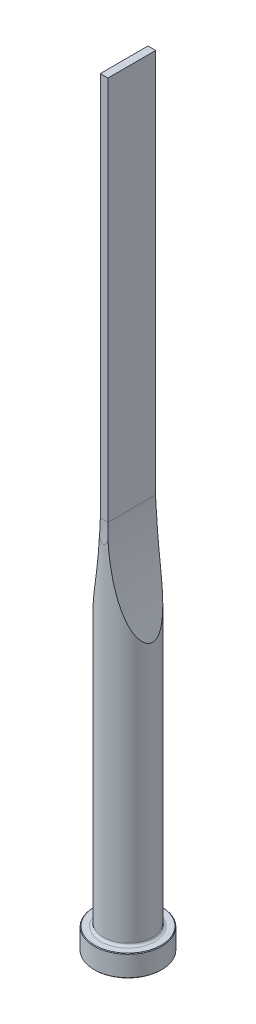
ISO-10303-21;
HEADER;
FILE_DESCRIPTION(('STEP AP214'),'2;1');
FILE_NAME('part.step','',(''),(''),'','','');
FILE_SCHEMA(('AUTOMOTIVE_DESIGN { 1 0 10303 214 1 1 1 1 }'));
ENDSEC;
DATA;
#1=APPLICATION_CONTEXT('core data for automotive mechanical design processes');
#2=APPLICATION_PROTOCOL_DEFINITION('international standard','automotive_design',2000,#1);
#3=PRODUCT_CONTEXT('',#1,'mechanical');
#4=PRODUCT('Part','Part','',(#3));
#5=PRODUCT_RELATED_PRODUCT_CATEGORY('part','',(#4));
#6=PRODUCT_DEFINITION_FORMATION('','',#4);
#7=PRODUCT_DEFINITION_CONTEXT('part definition',#1,'design');
#8=PRODUCT_DEFINITION('design','',#6,#7);
#9=PRODUCT_DEFINITION_SHAPE('','',#8);
#10=(LENGTH_UNIT() NAMED_UNIT(*) SI_UNIT(.MILLI.,.METRE.));
#11=(NAMED_UNIT(*) PLANE_ANGLE_UNIT() SI_UNIT($,.RADIAN.));
#12=(NAMED_UNIT(*) SI_UNIT($,.STERADIAN.) SOLID_ANGLE_UNIT());
#13=UNCERTAINTY_MEASURE_WITH_UNIT(LENGTH_MEASURE(1.E-05),#10,'distance_accuracy_value','');
#14=(GEOMETRIC_REPRESENTATION_CONTEXT(3) GLOBAL_UNCERTAINTY_ASSIGNED_CONTEXT((#13)) GLOBAL_UNIT_ASSIGNED_CONTEXT((#10,
#11,#12)) REPRESENTATION_CONTEXT('',''));
#15=CARTESIAN_POINT('',(0.,0.,0.));
#16=DIRECTION('',(0.,0.,1.));
#17=DIRECTION('',(1.,0.,0.));
#18=AXIS2_PLACEMENT_3D('',#15,#16,#17);
#19=CARTESIAN_POINT('',(0.,0.,0.));
#20=DIRECTION('',(0.,1.,0.));
#21=DIRECTION('',(-1.,0.,0.));
#22=AXIS2_PLACEMENT_3D('',#19,#20,#21);
#23=PLANE('',#22);
#24=CARTESIAN_POINT('',(0.,0.,0.));
#25=DIRECTION('',(0.,1.,0.));
#26=DIRECTION('',(-1.,0.,0.));
#27=AXIS2_PLACEMENT_3D('',#24,#25,#26);
#28=CIRCLE('',#27,10.8);
#29=CARTESIAN_POINT('',(-10.8,0.,0.));
#30=VERTEX_POINT('',#29);
#31=EDGE_CURVE('E133',#30,#30,#28,.T.);
#32=ORIENTED_EDGE('',*,*,#31,.F.);
#33=EDGE_LOOP('',(#32));
#34=FACE_BOUND('',#33,.T.);
#35=ADVANCED_FACE('F32',(#34),#23,.F.);
#36=CARTESIAN_POINT('',(0.,0.,0.));
#37=DIRECTION('',(0.,1.,0.));
#38=DIRECTION('',(-1.,0.,0.));
#39=AXIS2_PLACEMENT_3D('',#36,#37,#38);
#40=CONICAL_SURFACE('',#39,10.8,0.785398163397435);
#41=CARTESIAN_POINT('',(0.,0.200000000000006,0.));
#42=DIRECTION('',(0.,1.,0.));
#43=DIRECTION('',(-1.,0.,0.));
#44=AXIS2_PLACEMENT_3D('',#41,#42,#43);
#45=CIRCLE('',#44,11.);
#46=CARTESIAN_POINT('',(-11.,0.200000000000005,0.));
#47=VERTEX_POINT('',#46);
#48=EDGE_CURVE('E130',#47,#47,#45,.T.);
#49=ORIENTED_EDGE('',*,*,#48,.F.);
#50=EDGE_LOOP('',(#49));
#51=FACE_BOUND('',#50,.T.);
#52=ORIENTED_EDGE('',*,*,#31,.T.);
#53=EDGE_LOOP('',(#52));
#54=FACE_BOUND('',#53,.T.);
#55=ADVANCED_FACE('F171',(#51,#54),#40,.T.);
#56=CARTESIAN_POINT('',(0.,250.,0.));
#57=DIRECTION('',(0.,1.,0.));
#58=DIRECTION('',(-1.,0.,0.));
#59=AXIS2_PLACEMENT_3D('',#56,#57,#58);
#60=CYLINDRICAL_SURFACE('',#59,11.);
#61=CARTESIAN_POINT('',(0.,6.8,0.));
#62=DIRECTION('',(0.,1.,0.));
#63=DIRECTION('',(-1.,0.,0.));
#64=AXIS2_PLACEMENT_3D('',#61,#62,#63);
#65=CIRCLE('',#64,11.);
#66=CARTESIAN_POINT('',(-11.,6.8,0.));
#67=VERTEX_POINT('',#66);
#68=EDGE_CURVE('E127',#67,#67,#65,.T.);
#69=ORIENTED_EDGE('',*,*,#68,.F.);
#70=EDGE_LOOP('',(#69));
#71=FACE_BOUND('',#70,.T.);
#72=ORIENTED_EDGE('',*,*,#48,.T.);
#73=EDGE_LOOP('',(#72));
#74=FACE_BOUND('',#73,.T.);
#75=ADVANCED_FACE('F176',(#71,#74),#60,.T.);
#76=CARTESIAN_POINT('',(0.,6.8,0.));
#77=DIRECTION('',(0.,-1.,0.));
#78=DIRECTION('',(1.,0.,0.));
#79=AXIS2_PLACEMENT_3D('',#76,#77,#78);
#80=CONICAL_SURFACE('',#79,11.,0.78539816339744);
#81=CARTESIAN_POINT('',(0.,7.00000000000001,0.));
#82=DIRECTION('',(0.,1.,0.));
#83=DIRECTION('',(-1.,0.,0.));
#84=AXIS2_PLACEMENT_3D('',#81,#82,#83);
#85=CIRCLE('',#84,10.8);
#86=CARTESIAN_POINT('',(-10.8,7.00000000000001,0.));
#87=VERTEX_POINT('',#86);
#88=EDGE_CURVE('E124',#87,#87,#85,.T.);
#89=ORIENTED_EDGE('',*,*,#88,.F.);
#90=EDGE_LOOP('',(#89));
#91=FACE_BOUND('',#90,.T.);
#92=ORIENTED_EDGE('',*,*,#68,.T.);
#93=EDGE_LOOP('',(#92));
#94=FACE_BOUND('',#93,.T.);
#95=ADVANCED_FACE('F183',(#91,#94),#80,.T.);
#96=CARTESIAN_POINT('',(10.8,7.,0.));
#97=DIRECTION('',(0.,-1.,0.));
#98=DIRECTION('',(1.,0.,0.));
#99=AXIS2_PLACEMENT_3D('',#96,#97,#98);
#100=PLANE('',#99);
#101=CARTESIAN_POINT('',(0.,7.00000000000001,0.));
#102=DIRECTION('',(0.,1.,0.));
#103=DIRECTION('',(-1.,0.,0.));
#104=AXIS2_PLACEMENT_3D('',#101,#102,#103);
#105=CIRCLE('',#104,8.80000000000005);
#106=CARTESIAN_POINT('',(-8.80000000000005,7.00000000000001,0.));
#107=VERTEX_POINT('',#106);
#108=EDGE_CURVE('E121',#107,#107,#105,.T.);
#109=ORIENTED_EDGE('',*,*,#108,.F.);
#110=EDGE_LOOP('',(#109));
#111=FACE_BOUND('',#110,.T.);
#112=ORIENTED_EDGE('',*,*,#88,.T.);
#113=EDGE_LOOP('',(#112));
#114=FACE_BOUND('',#113,.T.);
#115=ADVANCED_FACE('F190',(#111,#114),#100,.F.);
#116=CARTESIAN_POINT('',(0.,7.8,0.));
#117=DIRECTION('',(0.,1.,0.));
#118=DIRECTION('',(-1.,0.,0.));
#119=AXIS2_PLACEMENT_3D('',#116,#117,#118);
#120=TOROIDAL_SURFACE('',#119,8.80000000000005,0.8);
#121=CARTESIAN_POINT('',(0.,7.8,0.));
#122=DIRECTION('',(0.,1.,0.));
#123=DIRECTION('',(-1.,0.,0.));
#124=AXIS2_PLACEMENT_3D('',#121,#122,#123);
#125=CIRCLE('',#124,8.00000000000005);
#126=CARTESIAN_POINT('',(-8.00000000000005,7.8,0.));
#127=VERTEX_POINT('',#126);
#128=EDGE_CURVE('E112',#127,#127,#125,.T.);
#129=ORIENTED_EDGE('',*,*,#128,.F.);
#130=EDGE_LOOP('',(#129));
#131=FACE_BOUND('',#130,.T.);
#132=ORIENTED_EDGE('',*,*,#108,.T.);
#133=EDGE_LOOP('',(#132));
#134=FACE_BOUND('',#133,.T.);
#135=ADVANCED_FACE('F168',(#131,#134),#120,.F.);
#136=CARTESIAN_POINT('',(0.,250.,0.));
#137=DIRECTION('',(0.,1.,0.));
#138=DIRECTION('',(-1.,0.,0.));
#139=AXIS2_PLACEMENT_3D('',#136,#137,#138);
#140=CYLINDRICAL_SURFACE('',#139,8.00000000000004);
#141=CARTESIAN_POINT('',(8.00000000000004,90.8029606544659,0.));
#142=CARTESIAN_POINT('',(8.00000026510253,90.8029600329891,0.0938122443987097));
#143=CARTESIAN_POINT('',(7.99834450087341,90.80698987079,0.187620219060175));
#144=CARTESIAN_POINT('',(7.99177963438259,90.8229783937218,0.374456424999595));
#145=CARTESIAN_POINT('',(7.98686934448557,90.8349399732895,0.467484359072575));
#146=CARTESIAN_POINT('',(7.96742702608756,90.8823464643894,0.74449070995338));
#147=CARTESIAN_POINT('',(7.94818381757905,90.929312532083,0.926267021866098));
#148=CARTESIAN_POINT('',(7.89369415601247,91.0628164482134,1.31794712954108));
#149=CARTESIAN_POINT('',(7.85585748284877,91.1557891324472,1.52523495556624));
#150=CARTESIAN_POINT('',(7.76860681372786,91.3715824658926,1.92093916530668));
#151=CARTESIAN_POINT('',(7.71917225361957,91.4944561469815,2.10932117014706));
#152=CARTESIAN_POINT('',(7.62330404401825,91.7345688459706,2.43048963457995));
#153=CARTESIAN_POINT('',(7.57832229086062,91.8478261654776,2.56676942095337));
#154=CARTESIAN_POINT('',(7.48466719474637,92.0851812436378,2.82826049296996));
#155=CARTESIAN_POINT('',(7.43599151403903,92.2092858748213,2.95346465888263));
#156=CARTESIAN_POINT('',(7.33595072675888,92.466150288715,3.19386992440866));
#157=CARTESIAN_POINT('',(7.28458133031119,92.5989239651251,3.30905424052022));
#158=CARTESIAN_POINT('',(7.17999527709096,92.8712652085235,3.53024569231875));
#159=CARTESIAN_POINT('',(7.12677789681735,93.0108354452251,3.63624917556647));
#160=CARTESIAN_POINT('',(7.01894146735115,93.2958666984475,3.84028904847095));
#161=CARTESIAN_POINT('',(6.96431849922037,93.4413450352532,3.93829903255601));
#162=CARTESIAN_POINT('',(6.85428087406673,93.7368030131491,4.12683031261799));
#163=CARTESIAN_POINT('',(6.79886605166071,93.886783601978,4.2173500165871));
#164=CARTESIAN_POINT('',(6.63190545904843,94.3424953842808,4.47892704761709));
#165=CARTESIAN_POINT('',(6.51971379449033,94.6538114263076,4.63987327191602));
#166=CARTESIAN_POINT('',(6.2954138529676,95.2875164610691,4.93992334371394));
#167=CARTESIAN_POINT('',(6.18330624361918,95.609927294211,5.07898070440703));
#168=CARTESIAN_POINT('',(6.01631941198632,96.0993176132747,5.2736291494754));
#169=CARTESIAN_POINT('',(5.96086316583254,96.2633788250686,5.33617863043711));
#170=CARTESIAN_POINT('',(5.85043562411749,96.5932289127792,5.45702390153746));
#171=CARTESIAN_POINT('',(5.79546434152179,96.7590178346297,5.51531957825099));
#172=CARTESIAN_POINT('',(5.65519725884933,97.1862442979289,5.65984603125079));
#173=CARTESIAN_POINT('',(5.5703228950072,97.4487803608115,5.74324284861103));
#174=CARTESIAN_POINT('',(5.40227851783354,97.9769442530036,5.90158511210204));
#175=CARTESIAN_POINT('',(5.3191086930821,98.2425724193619,5.97652962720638));
#176=CARTESIAN_POINT('',(5.15466196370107,98.7765214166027,6.11892936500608));
#177=CARTESIAN_POINT('',(5.07338579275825,99.044843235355,6.18638172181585));
#178=CARTESIAN_POINT('',(4.91291989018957,99.583712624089,6.31456619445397));
#179=CARTESIAN_POINT('',(4.83373027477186,99.8542603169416,6.3752979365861));
#180=CARTESIAN_POINT('',(4.59921321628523,100.669743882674,6.54867925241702));
#181=CARTESIAN_POINT('',(4.44722690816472,101.217581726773,6.65227031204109));
#182=CARTESIAN_POINT('',(4.15294399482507,102.318997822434,6.83984073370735));
#183=CARTESIAN_POINT('',(4.01064567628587,102.87257503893,6.92382356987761));
#184=CARTESIAN_POINT('',(3.7354872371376,103.987119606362,7.0760844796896));
#185=CARTESIAN_POINT('',(3.60267669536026,104.548109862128,7.14428371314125));
#186=CARTESIAN_POINT('',(3.34757576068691,105.673929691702,7.26730852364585));
#187=CARTESIAN_POINT('',(3.22528566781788,106.238759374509,7.32213371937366));
#188=CARTESIAN_POINT('',(2.99154866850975,107.371056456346,7.42069405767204));
#189=CARTESIAN_POINT('',(2.88009178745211,107.938520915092,7.46443946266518));
#190=CARTESIAN_POINT('',(2.66803590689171,109.076105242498,7.54283474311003));
#191=CARTESIAN_POINT('',(2.56743717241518,109.64622517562,7.57748439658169));
#192=CARTESIAN_POINT('',(2.37380329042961,110.809107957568,7.64040492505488));
#193=CARTESIAN_POINT('',(2.28116700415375,111.401951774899,7.66840353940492));
#194=CARTESIAN_POINT('',(2.10773403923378,112.58965672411,7.71787436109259));
#195=CARTESIAN_POINT('',(2.02693779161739,113.184517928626,7.73934633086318));
#196=CARTESIAN_POINT('',(1.87723712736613,114.375979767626,7.77701336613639));
#197=CARTESIAN_POINT('',(1.80833431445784,114.972580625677,7.79320772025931));
#198=CARTESIAN_POINT('',(1.68247616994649,116.167141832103,7.82134453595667));
#199=CARTESIAN_POINT('',(1.62552089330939,116.765102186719,7.8332869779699));
#200=CARTESIAN_POINT('',(1.52353769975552,117.962706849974,7.85375958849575));
#201=CARTESIAN_POINT('',(1.4785219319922,118.562352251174,7.8622862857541));
#202=CARTESIAN_POINT('',(1.40051616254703,119.762458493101,7.87655546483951));
#203=CARTESIAN_POINT('',(1.36752619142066,120.362919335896,7.88229793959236));
#204=CARTESIAN_POINT('',(1.31358947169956,121.564358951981,7.89146568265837));
#205=CARTESIAN_POINT('',(1.29264192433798,122.165337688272,7.89489110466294));
#206=CARTESIAN_POINT('',(1.26279614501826,123.367601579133,7.8997198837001));
#207=CARTESIAN_POINT('',(1.25389790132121,123.968886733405,7.90112324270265));
#208=CARTESIAN_POINT('',(1.24815287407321,125.171883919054,7.90203283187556));
#209=CARTESIAN_POINT('',(1.251313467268,125.773595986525,7.90153790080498));
#210=CARTESIAN_POINT('',(1.26970123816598,126.976831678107,7.8986040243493));
#211=CARTESIAN_POINT('',(1.28492842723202,127.57835530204,7.89616507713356));
#212=CARTESIAN_POINT('',(1.32744390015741,128.781000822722,7.8891290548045));
#213=CARTESIAN_POINT('',(1.35473292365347,129.382122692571,7.88453184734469));
#214=CARTESIAN_POINT('',(1.42135959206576,130.583672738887,7.87279376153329));
#215=CARTESIAN_POINT('',(1.46069720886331,131.184100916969,7.86565288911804));
#216=CARTESIAN_POINT('',(1.55135792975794,132.383420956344,7.84827481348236));
#217=CARTESIAN_POINT('',(1.60266934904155,132.982313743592,7.83804062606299));
#218=CARTESIAN_POINT('',(1.71727134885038,134.178873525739,7.81373223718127));
#219=CARTESIAN_POINT('',(1.78056188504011,134.776540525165,7.79965804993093));
#220=CARTESIAN_POINT('',(1.91907692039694,135.970286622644,7.76673757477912));
#221=CARTESIAN_POINT('',(1.99429995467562,136.56636590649,7.74789187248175));
#222=CARTESIAN_POINT('',(2.15663252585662,137.756670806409,7.70428465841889));
#223=CARTESIAN_POINT('',(2.24374167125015,138.350896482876,7.67952334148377));
#224=CARTESIAN_POINT('',(2.42976271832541,139.537048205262,7.62271037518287));
#225=CARTESIAN_POINT('',(2.52867257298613,140.128974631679,7.59065998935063));
#226=CARTESIAN_POINT('',(2.73820717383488,141.310190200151,7.51761515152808));
#227=CARTESIAN_POINT('',(2.84883162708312,141.899479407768,7.4766209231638));
#228=CARTESIAN_POINT('',(3.08176087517,143.075430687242,7.38366415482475));
#229=CARTESIAN_POINT('',(3.20407586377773,143.662089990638,7.33169199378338));
#230=CARTESIAN_POINT('',(3.4600992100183,144.831580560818,7.21439925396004));
#231=CARTESIAN_POINT('',(3.59380724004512,145.414411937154,7.14907905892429));
#232=CARTESIAN_POINT('',(3.87131633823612,146.571205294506,7.00266751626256));
#233=CARTESIAN_POINT('',(4.0150380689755,147.145200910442,6.92169274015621));
#234=CARTESIAN_POINT('',(4.31300927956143,148.287506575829,6.74006510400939));
#235=CARTESIAN_POINT('',(4.46726059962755,148.855815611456,6.6394087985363));
#236=CARTESIAN_POINT('',(4.70582882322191,149.702069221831,6.47028575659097));
#237=CARTESIAN_POINT('',(4.78647968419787,149.982886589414,6.41094547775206));
#238=CARTESIAN_POINT('',(4.95008800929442,150.542319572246,6.28548116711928));
#239=CARTESIAN_POINT('',(5.03304534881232,150.820935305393,6.21935750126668));
#240=CARTESIAN_POINT('',(5.20107759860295,151.375497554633,6.07953381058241));
#241=CARTESIAN_POINT('',(5.28615168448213,151.65144505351,6.00583670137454));
#242=CARTESIAN_POINT('',(5.4582341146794,152.200286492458,5.84988654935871));
#243=CARTESIAN_POINT('',(5.54524223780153,152.473180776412,5.7676344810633));
#244=CARTESIAN_POINT('',(5.67806423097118,152.883061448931,5.63591979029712));
#245=CARTESIAN_POINT('',(5.72326667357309,153.021401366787,5.59003697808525));
#246=CARTESIAN_POINT('',(5.81405871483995,153.297013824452,5.49554477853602));
#247=CARTESIAN_POINT('',(5.85964830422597,153.434286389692,5.4469354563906));
#248=CARTESIAN_POINT('',(5.99693707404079,153.844381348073,5.29671475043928));
#249=CARTESIAN_POINT('',(6.089146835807,154.115451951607,5.1907198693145));
#250=CARTESIAN_POINT('',(6.27444481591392,154.651907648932,4.96514550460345));
#251=CARTESIAN_POINT('',(6.36753373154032,154.917287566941,4.84555422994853));
#252=CARTESIAN_POINT('',(6.55371367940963,155.440368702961,4.59061900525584));
#253=CARTESIAN_POINT('',(6.64680470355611,155.698072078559,4.4552795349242));
#254=CARTESIAN_POINT('',(6.80461930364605,156.128986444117,4.20854013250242));
#255=CARTESIAN_POINT('',(6.86963437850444,156.30475796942,4.10180464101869));
#256=CARTESIAN_POINT('',(6.9984930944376,156.649920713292,3.87785953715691));
#257=CARTESIAN_POINT('',(7.06233704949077,156.819313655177,3.7606527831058));
#258=CARTESIAN_POINT('',(7.18797318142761,157.149756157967,3.51455569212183));
#259=CARTESIAN_POINT('',(7.24976878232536,157.310819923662,3.38568635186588));
#260=CARTESIAN_POINT('',(7.37029409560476,157.622428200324,3.11460298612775));
#261=CARTESIAN_POINT('',(7.42902581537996,157.772979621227,2.97239787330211));
#262=CARTESIAN_POINT('',(7.5492048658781,158.078802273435,2.65370528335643));
#263=CARTESIAN_POINT('',(7.61003609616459,158.232207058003,2.47515980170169));
#264=CARTESIAN_POINT('',(7.72278712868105,158.514590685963,2.0969876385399));
#265=CARTESIAN_POINT('',(7.7747172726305,158.643597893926,1.89738586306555));
#266=CARTESIAN_POINT('',(7.85662422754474,158.846040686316,1.5177163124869));
#267=CARTESIAN_POINT('',(7.88890499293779,158.925400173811,1.34135369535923));
#268=CARTESIAN_POINT('',(7.9422571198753,159.056203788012,0.976901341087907));
#269=CARTESIAN_POINT('',(7.96334089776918,159.107678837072,0.788824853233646));
#270=CARTESIAN_POINT('',(7.99214354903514,159.177929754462,0.403868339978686));
#271=CARTESIAN_POINT('',(7.99975120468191,159.196433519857,0.20692868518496));
#272=CARTESIAN_POINT('',(8.00023647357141,159.197615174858,-0.187071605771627));
#273=CARTESIAN_POINT('',(7.99311624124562,159.180298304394,-0.384132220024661));
#274=CARTESIAN_POINT('',(7.96684480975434,159.116227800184,-0.747314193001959));
#275=CARTESIAN_POINT('',(7.94927624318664,159.073344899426,-0.914265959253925));
#276=CARTESIAN_POINT('',(7.90511506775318,158.965181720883,-1.23939979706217));
#277=CARTESIAN_POINT('',(7.87851864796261,158.899891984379,-1.39757813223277));
#278=CARTESIAN_POINT('',(7.80150655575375,158.710002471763,-1.7874113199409));
#279=CARTESIAN_POINT('',(7.74602888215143,158.572516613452,-2.01175610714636));
#280=CARTESIAN_POINT('',(7.62368478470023,158.266599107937,-2.43480475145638));
#281=CARTESIAN_POINT('',(7.55678605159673,158.098079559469,-2.63343297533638));
#282=CARTESIAN_POINT('',(7.42485305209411,157.762373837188,-2.98360814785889));
#283=CARTESIAN_POINT('',(7.36064911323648,157.597703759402,-3.13793327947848));
#284=CARTESIAN_POINT('',(7.22873319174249,157.256166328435,-3.43092689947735));
#285=CARTESIAN_POINT('',(7.16101842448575,157.079289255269,-3.56958267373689));
#286=CARTESIAN_POINT('',(7.02335239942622,156.716078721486,-3.83336433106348));
#287=CARTESIAN_POINT('',(6.95339714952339,156.529727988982,-3.95846409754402));
#288=CARTESIAN_POINT('',(6.8123421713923,156.150007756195,-4.19656018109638));
#289=CARTESIAN_POINT('',(6.74124277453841,155.956640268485,-4.30955993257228));
#290=CARTESIAN_POINT('',(6.57376514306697,155.496135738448,-4.56245246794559));
#291=CARTESIAN_POINT('',(6.47718857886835,155.226715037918,-4.69804436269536));
#292=CARTESIAN_POINT('',(6.28429832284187,154.680189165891,-4.95309298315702));
#293=CARTESIAN_POINT('',(6.18798476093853,154.403080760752,-5.07254279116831));
#294=CARTESIAN_POINT('',(5.99627862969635,153.842518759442,-5.29778630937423));
#295=CARTESIAN_POINT('',(5.90088780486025,153.559055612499,-5.40355758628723));
#296=CARTESIAN_POINT('',(5.71175237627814,152.987476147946,-5.60310348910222));
#297=CARTESIAN_POINT('',(5.61800754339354,152.699360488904,-5.69687979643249));
#298=CARTESIAN_POINT('',(5.4321099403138,152.117952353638,-5.87441675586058));
#299=CARTESIAN_POINT('',(5.33996671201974,151.824641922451,-5.95812831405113));
#300=CARTESIAN_POINT('',(5.15802018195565,151.234829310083,-6.11631871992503));
#301=CARTESIAN_POINT('',(5.0682169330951,150.938327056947,-6.1907973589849));
#302=CARTESIAN_POINT('',(4.89125436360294,150.342916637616,-6.33153994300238));
#303=CARTESIAN_POINT('',(4.80409269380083,150.044010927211,-6.39781135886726));
#304=CARTESIAN_POINT('',(4.63249445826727,149.443918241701,-6.52313376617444));
#305=CARTESIAN_POINT('',(4.54805792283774,149.142731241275,-6.58218467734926));
#306=CARTESIAN_POINT('',(4.34204446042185,148.392794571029,-6.72076328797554));
#307=CARTESIAN_POINT('',(4.22217368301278,147.942864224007,-6.79644911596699));
#308=CARTESIAN_POINT('',(3.98900738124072,147.039438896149,-6.93586698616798));
#309=CARTESIAN_POINT('',(3.87571251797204,146.585943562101,-6.99959782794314));
#310=CARTESIAN_POINT('',(3.65588836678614,145.675851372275,-7.11688148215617));
#311=CARTESIAN_POINT('',(3.54936137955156,145.219253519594,-7.17043084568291));
#312=CARTESIAN_POINT('',(3.34326760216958,144.303540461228,-7.26880963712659));
#313=CARTESIAN_POINT('',(3.24370115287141,143.844425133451,-7.31363863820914));
#314=CARTESIAN_POINT('',(3.05148006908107,142.923248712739,-7.39590565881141));
#315=CARTESIAN_POINT('',(2.95883785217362,142.461183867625,-7.43333058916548));
#316=CARTESIAN_POINT('',(2.78074133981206,141.535192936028,-7.50177003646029));
#317=CARTESIAN_POINT('',(2.69528727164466,141.071266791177,-7.53278435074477));
#318=CARTESIAN_POINT('',(2.449842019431,139.677263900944,-7.61763803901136));
#319=CARTESIAN_POINT('',(2.3007233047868,138.744749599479,-7.66330625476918));
#320=CARTESIAN_POINT('',(2.03152927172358,136.872701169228,-7.73901783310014));
#321=CARTESIAN_POINT('',(1.91152385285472,135.933155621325,-7.76902378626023));
#322=CARTESIAN_POINT('',(1.70120365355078,134.050431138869,-7.81777190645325));
#323=CARTESIAN_POINT('',(1.61088985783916,133.10725208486,-7.8365136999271));
#324=CARTESIAN_POINT('',(1.46015730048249,131.219327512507,-7.86599149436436));
#325=CARTESIAN_POINT('',(1.3997091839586,130.274584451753,-7.87673536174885));
#326=CARTESIAN_POINT('',(1.30864636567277,128.383624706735,-7.89237400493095));
#327=CARTESIAN_POINT('',(1.27803147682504,127.437408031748,-7.89726881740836));
#328=CARTESIAN_POINT('',(1.24538021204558,125.466676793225,-7.90249069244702));
#329=CARTESIAN_POINT('',(1.24589914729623,124.442117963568,-7.90240932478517));
#330=CARTESIAN_POINT('',(1.28191589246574,122.393606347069,-7.89664606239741));
#331=CARTESIAN_POINT('',(1.3174145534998,121.369653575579,-7.890964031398));
#332=CARTESIAN_POINT('',(1.42339546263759,119.322628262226,-7.87253686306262));
#333=CARTESIAN_POINT('',(1.49391165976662,118.299557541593,-7.85978487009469));
#334=CARTESIAN_POINT('',(1.66984675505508,116.256594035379,-7.82430364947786));
#335=CARTESIAN_POINT('',(1.77526429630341,115.236701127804,-7.80157480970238));
#336=CARTESIAN_POINT('',(1.95904103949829,113.713544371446,-7.75667598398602));
#337=CARTESIAN_POINT('',(2.02433095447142,113.208510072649,-7.73997776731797));
#338=CARTESIAN_POINT('',(2.16344843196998,112.199784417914,-7.70225341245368));
#339=CARTESIAN_POINT('',(2.23727579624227,111.69609303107,-7.68122737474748));
#340=CARTESIAN_POINT('',(2.39344097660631,110.690176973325,-7.63400890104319));
#341=CARTESIAN_POINT('',(2.47578036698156,110.187952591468,-7.60781550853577));
#342=CARTESIAN_POINT('',(2.64890138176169,109.18531928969,-7.54928305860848));
#343=CARTESIAN_POINT('',(2.7396829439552,108.684910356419,-7.51694404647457));
#344=CARTESIAN_POINT('',(2.92946025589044,107.687004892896,-7.44503494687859));
#345=CARTESIAN_POINT('',(3.02844258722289,107.189504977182,-7.40547654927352));
#346=CARTESIAN_POINT('',(3.23464757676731,106.196950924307,-7.3177602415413));
#347=CARTESIAN_POINT('',(3.34187049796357,105.701896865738,-7.26960205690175));
#348=CARTESIAN_POINT('',(3.56436615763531,104.714896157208,-7.16313487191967));
#349=CARTESIAN_POINT('',(3.67963572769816,104.222948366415,-7.10482985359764));
#350=CARTESIAN_POINT('',(3.91805446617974,103.242571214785,-6.97618941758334));
#351=CARTESIAN_POINT('',(4.04120279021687,102.754141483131,-6.90585528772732));
#352=CARTESIAN_POINT('',(4.21329367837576,102.094897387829,-6.80080442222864));
#353=CARTESIAN_POINT('',(4.25892375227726,101.922207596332,-6.77233773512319));
#354=CARTESIAN_POINT('',(4.3511263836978,101.577412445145,-6.71347097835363));
#355=CARTESIAN_POINT('',(4.39769892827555,101.405307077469,-6.68307093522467));
#356=CARTESIAN_POINT('',(4.5388069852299,100.889921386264,-6.58878186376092));
#357=CARTESIAN_POINT('',(4.63473141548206,100.547577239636,-6.52180480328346));
#358=CARTESIAN_POINT('',(4.83032143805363,99.8650547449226,-6.3783027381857));
#359=CARTESIAN_POINT('',(4.92999531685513,99.5248834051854,-6.30175559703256));
#360=CARTESIAN_POINT('',(5.13261190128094,98.8481316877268,-6.13785597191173));
#361=CARTESIAN_POINT('',(5.23555450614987,98.5115511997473,-6.05050382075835));
#362=CARTESIAN_POINT('',(5.46071992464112,97.7903773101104,-5.84866445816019));
#363=CARTESIAN_POINT('',(5.5834368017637,97.406522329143,-5.73207009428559));
#364=CARTESIAN_POINT('',(5.83207198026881,96.6462090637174,-5.47891377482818));
#365=CARTESIAN_POINT('',(5.95799150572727,96.2697537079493,-5.34234408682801));
#366=CARTESIAN_POINT('',(6.14807410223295,95.7134754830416,-5.11962998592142));
#367=CARTESIAN_POINT('',(6.21152554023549,95.5297585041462,-5.04256291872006));
#368=CARTESIAN_POINT('',(6.33868335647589,95.1653639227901,-4.88176358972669));
#369=CARTESIAN_POINT('',(6.40238970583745,94.984685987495,-4.79803206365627));
#370=CARTESIAN_POINT('',(6.52974372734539,94.6270814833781,-4.62321652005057));
#371=CARTESIAN_POINT('',(6.59339140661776,94.4501521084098,-4.53213826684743));
#372=CARTESIAN_POINT('',(6.72031795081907,94.1006895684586,-4.34170775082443));
#373=CARTESIAN_POINT('',(6.78359689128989,93.9281554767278,-4.24235725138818));
#374=CARTESIAN_POINT('',(6.89274570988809,93.6332749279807,-4.06177950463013));
#375=CARTESIAN_POINT('',(6.93880530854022,93.5096936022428,-3.98268342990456));
#376=CARTESIAN_POINT('',(7.03023814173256,93.265970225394,-3.81897184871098));
#377=CARTESIAN_POINT('',(7.07561139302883,93.1458280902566,-3.73435647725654));
#378=CARTESIAN_POINT('',(7.16545377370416,92.909423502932,-3.5589324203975));
#379=CARTESIAN_POINT('',(7.20992117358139,92.7931682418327,-3.4681131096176));
#380=CARTESIAN_POINT('',(7.29748372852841,92.5656065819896,-3.27986458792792));
#381=CARTESIAN_POINT('',(7.34057904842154,92.4542995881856,-3.18243617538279));
#382=CARTESIAN_POINT('',(7.42541230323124,92.2364181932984,-2.97917893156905));
#383=CARTESIAN_POINT('',(7.46712917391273,92.1299121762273,-2.87326702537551));
#384=CARTESIAN_POINT('',(7.54802591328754,91.9244532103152,-2.6534967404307));
#385=CARTESIAN_POINT('',(7.58720523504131,91.8255018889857,-2.5396366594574));
#386=CARTESIAN_POINT('',(7.69959293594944,91.543012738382,-2.18570913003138));
#387=CARTESIAN_POINT('',(7.76800505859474,91.3729347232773,-1.93248529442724));
#388=CARTESIAN_POINT('',(7.86068239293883,91.1439695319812,-1.49614758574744));
#389=CARTESIAN_POINT('',(7.89179585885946,91.0675020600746,-1.32369077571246));
#390=CARTESIAN_POINT('',(7.94325969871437,90.9413492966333,-0.967818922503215));
#391=CARTESIAN_POINT('',(7.96363765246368,90.8915953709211,-0.784433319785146));
#392=CARTESIAN_POINT('',(7.9850074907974,90.8394764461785,-0.49946718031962));
#393=CARTESIAN_POINT('',(7.9906098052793,90.8258280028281,-0.400188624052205));
#394=CARTESIAN_POINT('',(7.99810642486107,90.8075692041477,-0.200605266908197));
#395=CARTESIAN_POINT('',(7.99999971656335,90.8029613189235,-0.100300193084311));
#396=CARTESIAN_POINT('',(8.00000000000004,90.8029606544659,0.));
#397=B_SPLINE_CURVE_WITH_KNOTS('',3,(#141,#142,#143,#144,#145,#146,#147,#148,#149,#150,#151,
#152,#153,#154,#155,#156,#157,#158,#159,#160,#161,#162,#163,#164,#165,#166,#167,#168,#169,#170,
#171,#172,#173,#174,#175,#176,#177,#178,#179,#180,#181,#182,#183,#184,#185,#186,#187,#188,#189,
#190,#191,#192,#193,#194,#195,#196,#197,#198,#199,#200,#201,#202,#203,#204,#205,#206,#207,#208,
#209,#210,#211,#212,#213,#214,#215,#216,#217,#218,#219,#220,#221,#222,#223,#224,#225,#226,#227,
#228,#229,#230,#231,#232,#233,#234,#235,#236,#237,#238,#239,#240,#241,#242,#243,#244,#245,#246,
#247,#248,#249,#250,#251,#252,#253,#254,#255,#256,#257,#258,#259,#260,#261,#262,#263,#264,#265,
#266,#267,#268,#269,#270,#271,#272,#273,#274,#275,#276,#277,#278,#279,#280,#281,#282,#283,#284,
#285,#286,#287,#288,#289,#290,#291,#292,#293,#294,#295,#296,#297,#298,#299,#300,#301,#302,#303,
#304,#305,#306,#307,#308,#309,#310,#311,#312,#313,#314,#315,#316,#317,#318,#319,#320,#321,#322,
#323,#324,#325,#326,#327,#328,#329,#330,#331,#332,#333,#334,#335,#336,#337,#338,#339,#340,#341,
#342,#343,#344,#345,#346,#347,#348,#349,#350,#351,#352,#353,#354,#355,#356,#357,#358,#359,#360,
#361,#362,#363,#364,#365,#366,#367,#368,#369,#370,#371,#372,#373,#374,#375,#376,#377,#378,#379,
#380,#381,#382,#383,#384,#385,#386,#387,#388,#389,#390,#391,#392,#393,#394,#395,#396),
.UNSPECIFIED.,.T.,.F.,(4,2,2,2,2,2,2,2,2,2,2,2,2,2,2,2,2,2,2,2,2,2,2,2,2,2,2,2,2,2,2,2,2,2,2,2,
2,2,2,2,2,2,2,2,2,2,2,2,2,2,2,2,2,2,2,2,2,2,2,2,2,2,2,2,2,2,2,2,2,2,2,2,2,2,2,2,2,2,2,2,2,2,2,2,
2,2,2,2,2,2,2,2,2,2,2,2,2,2,2,2,2,2,2,2,2,2,2,2,2,2,2,2,2,2,2,2,2,2,2,2,2,2,2,2,2,2,2,4),(0.,
0.281321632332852,0.562745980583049,1.12596306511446,1.81315351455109,2.50157175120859,
3.04927977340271,3.59733735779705,4.14629595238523,4.69547194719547,5.24639421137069,
5.79743327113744,6.90021798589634,8.00531404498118,8.55765540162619,9.11001148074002,
9.97456303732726,10.8392097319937,11.7041860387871,12.5692104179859,14.3022923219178,
16.0350669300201,17.7763185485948,19.5176198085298,21.2573022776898,22.9970271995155,
24.798934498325,26.6009073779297,28.4031230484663,30.2053470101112,32.0093978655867,
33.8134533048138,35.6173890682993,37.4213230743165,39.226360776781,41.0314001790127,
42.8365502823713,44.6416961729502,46.4450877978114,48.2484727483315,50.0516364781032,
51.8547408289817,53.6575328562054,55.4602798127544,57.2646133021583,59.0688949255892,
60.8602253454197,62.6518696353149,63.5461976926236,64.4404775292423,65.3344143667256,
66.2282494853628,66.6860206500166,67.1437808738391,68.059396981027,68.9758132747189,
69.8919695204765,70.5387023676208,71.1852592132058,71.8306743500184,72.4756611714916,
73.2032815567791,73.9300507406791,74.5160460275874,75.1013901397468,75.6915429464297,
76.2816094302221,76.7993074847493,77.3172243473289,78.1193408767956,78.9237653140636,
79.6266625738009,80.3301261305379,81.0349217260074,81.7395167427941,82.6889693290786,
83.6388275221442,84.5902242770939,85.5414875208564,86.4972172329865,87.452968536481,
88.4078433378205,89.3627287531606,90.7776786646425,92.1927705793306,93.6083409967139,
95.0239806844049,96.4421010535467,97.8602662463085,100.695941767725,103.538359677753,
106.380871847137,109.220584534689,112.060279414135,115.133337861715,118.206471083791,
121.282589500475,124.358588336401,125.88704652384,127.415469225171,128.944175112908,
130.472869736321,131.999110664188,133.525400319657,135.051092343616,136.576621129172,
137.119222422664,137.661816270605,138.747022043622,139.83478613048,140.922516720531,
142.18064447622,143.439260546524,144.066418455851,144.693507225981,145.320108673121,
145.946576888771,146.407814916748,146.869041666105,147.331079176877,147.793060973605,
148.260307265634,148.727653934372,149.658588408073,150.230255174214,150.80044606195,
151.101141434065,151.401918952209),.UNSPECIFIED.);
#398=CARTESIAN_POINT('',(1.38006479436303,120.163188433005,-7.88006479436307));
#399=VERTEX_POINT('',#398);
#400=CARTESIAN_POINT('',(1.38006479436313,120.163188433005,7.88006479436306));
#401=VERTEX_POINT('',#400);
#402=EDGE_CURVE('E138',#399,#401,#397,.T.);
#403=ORIENTED_EDGE('',*,*,#402,.T.);
#404=CARTESIAN_POINT('',(-1.98431348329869,125.,7.74999999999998));
#405=CARTESIAN_POINT('',(-1.9843167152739,125.310227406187,7.75000012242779));
#406=CARTESIAN_POINT('',(-1.97807758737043,125.620470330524,7.75160504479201));
#407=CARTESIAN_POINT('',(-1.95278869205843,126.240402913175,7.75801423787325));
#408=CARTESIAN_POINT('',(-1.93373880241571,126.550092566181,7.76281853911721));
#409=CARTESIAN_POINT('',(-1.88170740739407,127.168545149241,7.77559741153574));
#410=CARTESIAN_POINT('',(-1.84871351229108,127.477307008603,7.78357480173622));
#411=CARTESIAN_POINT('',(-1.76661059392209,128.092457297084,7.80261881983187));
#412=CARTESIAN_POINT('',(-1.71750945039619,128.398846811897,7.81368393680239));
#413=CARTESIAN_POINT('',(-1.59923669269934,129.00782620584,7.83876619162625));
#414=CARTESIAN_POINT('',(-1.530065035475,129.310416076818,7.852783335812));
#415=CARTESIAN_POINT('',(-1.40509547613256,129.758317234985,7.87574985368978));
#416=CARTESIAN_POINT('',(-1.35990520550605,129.906616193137,7.8837285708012));
#417=CARTESIAN_POINT('',(-1.26052233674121,130.200044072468,7.90023035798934));
#418=CARTESIAN_POINT('',(-1.20633656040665,130.345175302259,7.90875301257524));
#419=CARTESIAN_POINT('',(-1.08563979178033,130.631320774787,7.92623499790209));
#420=CARTESIAN_POINT('',(-1.01906689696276,130.77231003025,7.93519634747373));
#421=CARTESIAN_POINT('',(-0.905913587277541,130.976517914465,7.94863066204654));
#422=CARTESIAN_POINT('',(-0.865970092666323,131.043388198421,7.9531084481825));
#423=CARTESIAN_POINT('',(-0.780477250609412,131.173411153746,7.96195394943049));
#424=CARTESIAN_POINT('',(-0.734935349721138,131.236568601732,7.96632180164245));
#425=CARTESIAN_POINT('',(-0.636093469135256,131.357858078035,7.97482874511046));
#426=CARTESIAN_POINT('',(-0.582709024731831,131.415922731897,7.97896456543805));
#427=CARTESIAN_POINT('',(-0.466606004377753,131.521734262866,7.98659018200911));
#428=CARTESIAN_POINT('',(-0.403961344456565,131.569556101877,7.99008464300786));
#429=CARTESIAN_POINT('',(-0.303890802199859,131.626684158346,7.99429035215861));
#430=CARTESIAN_POINT('',(-0.270535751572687,131.643017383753,7.99549865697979));
#431=CARTESIAN_POINT('',(-0.201689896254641,131.670421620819,7.99753116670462));
#432=CARTESIAN_POINT('',(-0.16620065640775,131.681496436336,7.99835564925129));
#433=CARTESIAN_POINT('',(-0.0934740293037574,131.697347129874,7.99953699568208));
#434=CARTESIAN_POINT('',(-0.0562242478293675,131.702068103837,7.99988978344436));
#435=CARTESIAN_POINT('',(0.0184986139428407,131.704424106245,8.00006574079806));
#436=CARTESIAN_POINT('',(0.0559716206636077,131.70206135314,7.99988907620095));
#437=CARTESIAN_POINT('',(0.126456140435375,131.691099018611,7.99907121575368));
#438=CARTESIAN_POINT('',(0.159563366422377,131.683086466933,7.99847374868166));
#439=CARTESIAN_POINT('',(0.224196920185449,131.662232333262,7.9969233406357));
#440=CARTESIAN_POINT('',(0.255722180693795,131.649387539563,7.99597016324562));
#441=CARTESIAN_POINT('',(0.334694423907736,131.611135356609,7.99314270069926));
#442=CARTESIAN_POINT('',(0.380692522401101,131.582771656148,7.99105553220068));
#443=CARTESIAN_POINT('',(0.467817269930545,131.519390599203,7.98642960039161));
#444=CARTESIAN_POINT('',(0.508928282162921,131.484352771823,7.98388944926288));
#445=CARTESIAN_POINT('',(0.62151971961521,131.37679113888,7.97616511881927));
#446=CARTESIAN_POINT('',(0.687515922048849,131.298628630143,7.9706375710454));
#447=CARTESIAN_POINT('',(0.808549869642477,131.13439222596,7.95926471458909));
#448=CARTESIAN_POINT('',(0.863553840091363,131.048295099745,7.95341849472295));
#449=CARTESIAN_POINT('',(0.995128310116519,130.820249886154,7.93828495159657));
#450=CARTESIAN_POINT('',(1.06569888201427,130.674876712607,7.9289688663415));
#451=CARTESIAN_POINT('',(1.19356521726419,130.378285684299,7.91071942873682));
#452=CARTESIAN_POINT('',(1.25082971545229,130.227055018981,7.90178701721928));
#453=CARTESIAN_POINT('',(1.35570730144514,129.920417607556,7.88447171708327));
#454=CARTESIAN_POINT('',(1.40326961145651,129.764993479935,7.87609186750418));
#455=CARTESIAN_POINT('',(1.4904875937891,129.452132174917,7.8600502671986));
#456=CARTESIAN_POINT('',(1.53015172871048,129.294697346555,7.85238775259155));
#457=CARTESIAN_POINT('',(1.62389561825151,128.887904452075,7.83367180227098));
#458=CARTESIAN_POINT('',(1.67325812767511,128.637435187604,7.82318329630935));
#459=CARTESIAN_POINT('',(1.75948004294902,128.134239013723,7.804238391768));
#460=CARTESIAN_POINT('',(1.79633420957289,127.881511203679,7.79578284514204));
#461=CARTESIAN_POINT('',(1.85947965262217,127.374226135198,7.7809634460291));
#462=CARTESIAN_POINT('',(1.88575180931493,127.1196664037,7.77460338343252));
#463=CARTESIAN_POINT('',(1.9287903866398,126.609697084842,7.76403451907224));
#464=CARTESIAN_POINT('',(1.94555558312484,126.354287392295,7.7598259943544));
#465=CARTESIAN_POINT('',(1.98269985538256,125.587295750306,7.75046498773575));
#466=CARTESIAN_POINT('',(1.98992728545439,125.074954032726,7.74857715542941));
#467=CARTESIAN_POINT('',(1.97529230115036,124.307450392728,7.75230076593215));
#468=CARTESIAN_POINT('',(1.96618074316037,124.051933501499,7.75463124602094));
#469=CARTESIAN_POINT('',(1.93906690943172,123.541399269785,7.76145849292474));
#470=CARTESIAN_POINT('',(1.92106540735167,123.286381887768,7.76595507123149));
#471=CARTESIAN_POINT('',(1.87471171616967,122.768760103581,7.77727743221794));
#472=CARTESIAN_POINT('',(1.84603457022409,122.506186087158,7.78417584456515));
#473=CARTESIAN_POINT('',(1.77703413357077,121.982449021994,7.80021933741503));
#474=CARTESIAN_POINT('',(1.73670382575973,121.721286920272,7.80936577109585));
#475=CARTESIAN_POINT('',(1.64221244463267,121.202440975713,7.82978141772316));
#476=CARTESIAN_POINT('',(1.58809931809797,120.944748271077,7.84104323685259));
#477=CARTESIAN_POINT('',(1.46204823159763,120.434028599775,7.86553499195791));
#478=CARTESIAN_POINT('',(1.39013277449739,120.180996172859,7.87876243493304));
#479=CARTESIAN_POINT('',(1.24596652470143,119.758208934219,7.90260735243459));
#480=CARTESIAN_POINT('',(1.18030295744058,119.586266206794,7.91281560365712));
#481=CARTESIAN_POINT('',(1.06809293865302,119.334388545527,7.92846600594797));
#482=CARTESIAN_POINT('',(1.02839107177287,119.251413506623,7.93374063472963));
#483=CARTESIAN_POINT('',(0.943234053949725,119.088500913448,7.94431637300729));
#484=CARTESIAN_POINT('',(0.897783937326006,119.008560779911,7.94961745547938));
#485=CARTESIAN_POINT('',(0.799114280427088,118.852801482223,7.96014485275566));
#486=CARTESIAN_POINT('',(0.745844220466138,118.777013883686,7.96537041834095));
#487=CARTESIAN_POINT('',(0.629294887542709,118.633608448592,7.9754260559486));
#488=CARTESIAN_POINT('',(0.566066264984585,118.565952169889,7.98025795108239));
#489=CARTESIAN_POINT('',(0.463628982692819,118.478011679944,7.98661948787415));
#490=CARTESIAN_POINT('',(0.429641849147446,118.451733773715,7.98853391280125));
#491=CARTESIAN_POINT('',(0.358459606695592,118.403785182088,7.99204480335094));
#492=CARTESIAN_POINT('',(0.321263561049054,118.382115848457,7.99364117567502));
#493=CARTESIAN_POINT('',(0.243194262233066,118.344815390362,7.996399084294));
#494=CARTESIAN_POINT('',(0.202275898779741,118.329275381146,7.99755405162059));
#495=CARTESIAN_POINT('',(0.118169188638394,118.306672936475,7.99923672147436));
#496=CARTESIAN_POINT('',(0.0749872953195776,118.299587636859,7.99976611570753));
#497=CARTESIAN_POINT('',(-0.00588173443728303,118.295308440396,8.00008572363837));
#498=CARTESIAN_POINT('',(-0.0435052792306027,118.296885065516,7.9999678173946));
#499=CARTESIAN_POINT('',(-0.117827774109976,118.306921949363,7.99921877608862));
#500=CARTESIAN_POINT('',(-0.154525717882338,118.315389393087,7.99858710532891));
#501=CARTESIAN_POINT('',(-0.232595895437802,118.340362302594,7.99673039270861));
#502=CARTESIAN_POINT('',(-0.273575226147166,118.358065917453,7.995417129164));
#503=CARTESIAN_POINT('',(-0.352162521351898,118.399747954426,7.99234232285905));
#504=CARTESIAN_POINT('',(-0.389763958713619,118.4237381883,7.99057993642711));
#505=CARTESIAN_POINT('',(-0.485855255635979,118.493886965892,7.98546133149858));
#506=CARTESIAN_POINT('',(-0.541340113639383,118.544087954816,7.98183154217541));
#507=CARTESIAN_POINT('',(-0.644637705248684,118.651745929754,7.97415343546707));
#508=CARTESIAN_POINT('',(-0.692427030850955,118.709224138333,7.97010390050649));
#509=CARTESIAN_POINT('',(-0.79931919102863,118.85174363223,7.96021325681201));
#510=CARTESIAN_POINT('',(-0.855638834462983,118.938840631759,7.95428552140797));
#511=CARTESIAN_POINT('',(-0.959916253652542,119.117968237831,7.94237323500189));
#512=CARTESIAN_POINT('',(-1.00785629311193,119.210008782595,7.93638859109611));
#513=CARTESIAN_POINT('',(-1.09751573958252,119.397653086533,7.92448807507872));
#514=CARTESIAN_POINT('',(-1.13920034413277,119.493273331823,7.91857274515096));
#515=CARTESIAN_POINT('',(-1.21733644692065,119.686501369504,7.90693623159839));
#516=CARTESIAN_POINT('',(-1.25379292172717,119.78410716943,7.90121486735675));
#517=CARTESIAN_POINT('',(-1.34437964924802,120.043549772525,7.88643899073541));
#518=CARTESIAN_POINT('',(-1.39494790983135,120.206639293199,7.87758656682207));
#519=CARTESIAN_POINT('',(-1.48735690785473,120.535336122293,7.86065726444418));
#520=CARTESIAN_POINT('',(-1.52919309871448,120.700944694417,7.85258079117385));
#521=CARTESIAN_POINT('',(-1.64425478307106,121.200850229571,7.82960352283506));
#522=CARTESIAN_POINT('',(-1.70685011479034,121.537656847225,7.81598758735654));
#523=CARTESIAN_POINT('',(-1.8110270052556,122.21415962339,7.79248898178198));
#524=CARTESIAN_POINT('',(-1.85262553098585,122.553853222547,7.78260329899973));
#525=CARTESIAN_POINT('',(-1.91832121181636,123.234655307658,7.76667194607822));
#526=CARTESIAN_POINT('',(-1.9424365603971,123.575761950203,7.76062228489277));
#527=CARTESIAN_POINT('',(-1.96728840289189,124.0976152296,7.75434300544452));
#528=CARTESIAN_POINT('',(-1.97368703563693,124.27810210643,7.75271412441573));
#529=CARTESIAN_POINT('',(-1.98219712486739,124.639057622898,7.75054296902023));
#530=CARTESIAN_POINT('',(-1.98431160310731,124.81952618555,7.74999992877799));
#531=CARTESIAN_POINT('',(-1.98431348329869,125.,7.74999999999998));
#532=B_SPLINE_CURVE_WITH_KNOTS('',3,(#404,#405,#406,#407,#408,#409,#410,#411,#412,#413,#414,
#415,#416,#417,#418,#419,#420,#421,#422,#423,#424,#425,#426,#427,#428,#429,#430,#431,#432,#433,
#434,#435,#436,#437,#438,#439,#440,#441,#442,#443,#444,#445,#446,#447,#448,#449,#450,#451,#452,
#453,#454,#455,#456,#457,#458,#459,#460,#461,#462,#463,#464,#465,#466,#467,#468,#469,#470,#471,
#472,#473,#474,#475,#476,#477,#478,#479,#480,#481,#482,#483,#484,#485,#486,#487,#488,#489,#490,
#491,#492,#493,#494,#495,#496,#497,#498,#499,#500,#501,#502,#503,#504,#505,#506,#507,#508,#509,
#510,#511,#512,#513,#514,#515,#516,#517,#518,#519,#520,#521,#522,#523,#524,#525,#526,#527,#528,
#529,#530,#531),.UNSPECIFIED.,.T.,.F.,(4,2,2,2,2,2,2,2,2,2,2,2,2,2,2,2,2,2,2,2,2,2,2,2,2,2,2,2,
2,2,2,2,2,2,2,2,2,2,2,2,2,2,2,2,2,2,2,2,2,2,2,2,2,2,2,2,2,2,2,2,2,2,2,4),(0.,0.930639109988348,
1.86128709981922,2.7927637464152,3.72378538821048,4.65480902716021,5.12029423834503,
5.58542804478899,6.05295194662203,6.28681493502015,6.52037015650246,6.75665551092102,
6.99114758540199,7.10227588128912,7.21332366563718,7.32532499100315,7.43729124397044,
7.53907003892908,7.6409166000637,7.80221859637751,7.96402354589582,8.26964178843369,
8.57618510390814,9.06056112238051,9.54606401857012,10.0340461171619,10.5215025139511,
11.2875556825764,12.0539293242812,12.8216815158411,13.5895325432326,15.1252430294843,
15.8921995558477,16.6590893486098,17.451536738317,18.2444623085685,19.0346663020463,
19.8238765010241,20.3760654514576,20.652311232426,20.9283167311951,21.2061909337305,
21.4826949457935,21.611430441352,21.740203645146,21.8708248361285,22.0010919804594,
22.1133921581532,22.225809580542,22.359045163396,22.4925328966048,22.7160019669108,
22.9401384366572,23.251052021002,23.5626159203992,23.8758536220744,24.1887911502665,
24.7013662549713,25.2142075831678,26.2416829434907,27.2683266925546,28.2939005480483,
28.8356791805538,29.3770755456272),.UNSPECIFIED.);
#533=CARTESIAN_POINT('',(-1.38006479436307,120.163188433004,7.88006479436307));
#534=VERTEX_POINT('',#533);
#535=EDGE_CURVE('E104',#401,#534,#532,.T.);
#536=ORIENTED_EDGE('',*,*,#535,.T.);
#537=CARTESIAN_POINT('',(-8.00000000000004,90.8029606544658,0.));
#538=CARTESIAN_POINT('',(-8.00000026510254,90.802960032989,-0.09381224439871));
#539=CARTESIAN_POINT('',(-7.99834450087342,90.8069898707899,-0.187620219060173));
#540=CARTESIAN_POINT('',(-7.99177963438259,90.8229783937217,-0.374456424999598));
#541=CARTESIAN_POINT('',(-7.98686934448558,90.8349399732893,-0.467484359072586));
#542=CARTESIAN_POINT('',(-7.96742702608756,90.8823464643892,-0.7444907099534));
#543=CARTESIAN_POINT('',(-7.94818381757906,90.9293125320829,-0.926267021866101));
#544=CARTESIAN_POINT('',(-7.89369415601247,91.0628164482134,-1.31794712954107));
#545=CARTESIAN_POINT('',(-7.85585748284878,91.1557891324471,-1.52523495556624));
#546=CARTESIAN_POINT('',(-7.76860681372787,91.3715824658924,-1.92093916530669));
#547=CARTESIAN_POINT('',(-7.71917225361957,91.4944561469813,-2.10932117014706));
#548=CARTESIAN_POINT('',(-7.62330404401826,91.7345688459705,-2.43048963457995));
#549=CARTESIAN_POINT('',(-7.57832229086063,91.8478261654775,-2.56676942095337));
#550=CARTESIAN_POINT('',(-7.48466719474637,92.0851812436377,-2.82826049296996));
#551=CARTESIAN_POINT('',(-7.43599151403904,92.2092858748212,-2.95346465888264));
#552=CARTESIAN_POINT('',(-7.33595072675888,92.4661502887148,-3.19386992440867));
#553=CARTESIAN_POINT('',(-7.28458133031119,92.598923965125,-3.30905424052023));
#554=CARTESIAN_POINT('',(-7.17999527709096,92.8712652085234,-3.53024569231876));
#555=CARTESIAN_POINT('',(-7.12677789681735,93.010835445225,-3.63624917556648));
#556=CARTESIAN_POINT('',(-7.01894146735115,93.2958666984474,-3.84028904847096));
#557=CARTESIAN_POINT('',(-6.96431849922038,93.4413450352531,-3.93829903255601));
#558=CARTESIAN_POINT('',(-6.85428087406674,93.736803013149,-4.126830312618));
#559=CARTESIAN_POINT('',(-6.7988660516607,93.8867836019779,-4.21735001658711));
#560=CARTESIAN_POINT('',(-6.63190545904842,94.3424953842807,-4.47892704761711));
#561=CARTESIAN_POINT('',(-6.51971379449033,94.6538114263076,-4.63987327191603));
#562=CARTESIAN_POINT('',(-6.2954138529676,95.287516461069,-4.93992334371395));
#563=CARTESIAN_POINT('',(-6.18330624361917,95.6099272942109,-5.07898070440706));
#564=CARTESIAN_POINT('',(-6.01631941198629,96.0993176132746,-5.27362914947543));
#565=CARTESIAN_POINT('',(-5.96086316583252,96.2633788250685,-5.33617863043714));
#566=CARTESIAN_POINT('',(-5.85043562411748,96.5932289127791,-5.45702390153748));
#567=CARTESIAN_POINT('',(-5.7954643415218,96.7590178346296,-5.51531957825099));
#568=CARTESIAN_POINT('',(-5.65519725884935,97.1862442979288,-5.65984603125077));
#569=CARTESIAN_POINT('',(-5.57032289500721,97.4487803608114,-5.74324284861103));
#570=CARTESIAN_POINT('',(-5.40227851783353,97.9769442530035,-5.90158511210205));
#571=CARTESIAN_POINT('',(-5.3191086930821,98.2425724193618,-5.97652962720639));
#572=CARTESIAN_POINT('',(-5.15466196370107,98.7765214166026,-6.11892936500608));
#573=CARTESIAN_POINT('',(-5.07338579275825,99.0448432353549,-6.18638172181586));
#574=CARTESIAN_POINT('',(-4.91291989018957,99.5837126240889,-6.31456619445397));
#575=CARTESIAN_POINT('',(-4.83373027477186,99.8542603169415,-6.37529793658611));
#576=CARTESIAN_POINT('',(-4.59921321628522,100.669743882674,-6.54867925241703));
#577=CARTESIAN_POINT('',(-4.44722690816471,101.217581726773,-6.6522703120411));
#578=CARTESIAN_POINT('',(-4.15294399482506,102.318997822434,-6.83984073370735));
#579=CARTESIAN_POINT('',(-4.01064567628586,102.87257503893,-6.92382356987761));
#580=CARTESIAN_POINT('',(-3.73548723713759,103.987119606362,-7.0760844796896));
#581=CARTESIAN_POINT('',(-3.60267669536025,104.548109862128,-7.14428371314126));
#582=CARTESIAN_POINT('',(-3.3475757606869,105.673929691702,-7.26730852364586));
#583=CARTESIAN_POINT('',(-3.22528566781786,106.238759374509,-7.32213371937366));
#584=CARTESIAN_POINT('',(-2.99154866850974,107.371056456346,-7.42069405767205));
#585=CARTESIAN_POINT('',(-2.88009178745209,107.938520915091,-7.46443946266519));
#586=CARTESIAN_POINT('',(-2.66803590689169,109.076105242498,-7.54283474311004));
#587=CARTESIAN_POINT('',(-2.56743717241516,109.64622517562,-7.5774843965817));
#588=CARTESIAN_POINT('',(-2.37380329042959,110.809107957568,-7.64040492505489));
#589=CARTESIAN_POINT('',(-2.28116700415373,111.401951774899,-7.66840353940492));
#590=CARTESIAN_POINT('',(-2.10773403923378,112.58965672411,-7.71787436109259));
#591=CARTESIAN_POINT('',(-2.0269377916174,113.184517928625,-7.73934633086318));
#592=CARTESIAN_POINT('',(-1.87723712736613,114.375979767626,-7.77701336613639));
#593=CARTESIAN_POINT('',(-1.80833431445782,114.972580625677,-7.79320772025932));
#594=CARTESIAN_POINT('',(-1.68247616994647,116.167141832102,-7.82134453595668));
#595=CARTESIAN_POINT('',(-1.62552089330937,116.765102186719,-7.83328697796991));
#596=CARTESIAN_POINT('',(-1.52353769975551,117.962706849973,-7.85375958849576));
#597=CARTESIAN_POINT('',(-1.4785219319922,118.562352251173,-7.8622862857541));
#598=CARTESIAN_POINT('',(-1.40051616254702,119.7624584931,-7.87655546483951));
#599=CARTESIAN_POINT('',(-1.36752619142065,120.362919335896,-7.88229793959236));
#600=CARTESIAN_POINT('',(-1.31358947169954,121.564358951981,-7.89146568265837));
#601=CARTESIAN_POINT('',(-1.29264192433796,122.165337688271,-7.89489110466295));
#602=CARTESIAN_POINT('',(-1.26279614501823,123.367601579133,-7.8997198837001));
#603=CARTESIAN_POINT('',(-1.25389790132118,123.968886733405,-7.90112324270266));
#604=CARTESIAN_POINT('',(-1.24815287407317,125.171883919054,-7.90203283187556));
#605=CARTESIAN_POINT('',(-1.25131346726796,125.773595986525,-7.90153790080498));
#606=CARTESIAN_POINT('',(-1.26970123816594,126.976831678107,-7.89860402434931));
#607=CARTESIAN_POINT('',(-1.28492842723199,127.578355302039,-7.89616507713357));
#608=CARTESIAN_POINT('',(-1.32744390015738,128.781000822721,-7.88912905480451));
#609=CARTESIAN_POINT('',(-1.35473292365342,129.382122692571,-7.8845318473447));
#610=CARTESIAN_POINT('',(-1.42135959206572,130.583672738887,-7.8727937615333));
#611=CARTESIAN_POINT('',(-1.46069720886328,131.184100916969,-7.86565288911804));
#612=CARTESIAN_POINT('',(-1.55135792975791,132.383420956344,-7.84827481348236));
#613=CARTESIAN_POINT('',(-1.60266934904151,132.982313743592,-7.838040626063));
#614=CARTESIAN_POINT('',(-1.71727134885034,134.178873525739,-7.81373223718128));
#615=CARTESIAN_POINT('',(-1.78056188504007,134.776540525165,-7.79965804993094));
#616=CARTESIAN_POINT('',(-1.9190769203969,135.970286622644,-7.76673757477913));
#617=CARTESIAN_POINT('',(-1.99429995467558,136.56636590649,-7.74789187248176));
#618=CARTESIAN_POINT('',(-2.15663252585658,137.756670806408,-7.7042846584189));
#619=CARTESIAN_POINT('',(-2.2437416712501,138.350896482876,-7.67952334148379));
#620=CARTESIAN_POINT('',(-2.42976271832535,139.537048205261,-7.62271037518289));
#621=CARTESIAN_POINT('',(-2.52867257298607,140.128974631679,-7.59065998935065));
#622=CARTESIAN_POINT('',(-2.73820717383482,141.310190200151,-7.5176151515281));
#623=CARTESIAN_POINT('',(-2.84883162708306,141.899479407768,-7.47662092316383));
#624=CARTESIAN_POINT('',(-3.08176087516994,143.075430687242,-7.38366415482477));
#625=CARTESIAN_POINT('',(-3.20407586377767,143.662089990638,-7.33169199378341));
#626=CARTESIAN_POINT('',(-3.46009921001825,144.831580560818,-7.21439925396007));
#627=CARTESIAN_POINT('',(-3.59380724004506,145.414411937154,-7.14907905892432));
#628=CARTESIAN_POINT('',(-3.87131633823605,146.571205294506,-7.0026675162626));
#629=CARTESIAN_POINT('',(-4.01503806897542,147.145200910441,-6.92169274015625));
#630=CARTESIAN_POINT('',(-4.31300927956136,148.287506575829,-6.74006510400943));
#631=CARTESIAN_POINT('',(-4.4672605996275,148.855815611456,-6.63940879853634));
#632=CARTESIAN_POINT('',(-4.70582882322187,149.702069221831,-6.47028575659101));
#633=CARTESIAN_POINT('',(-4.78647968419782,149.982886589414,-6.4109454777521));
#634=CARTESIAN_POINT('',(-4.95008800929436,150.542319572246,-6.28548116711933));
#635=CARTESIAN_POINT('',(-5.03304534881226,150.820935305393,-6.21935750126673));
#636=CARTESIAN_POINT('',(-5.20107759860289,151.375497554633,-6.07953381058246));
#637=CARTESIAN_POINT('',(-5.28615168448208,151.65144505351,-6.0058367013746));
#638=CARTESIAN_POINT('',(-5.45823411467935,152.200286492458,-5.84988654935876));
#639=CARTESIAN_POINT('',(-5.54524223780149,152.473180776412,-5.76763448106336));
#640=CARTESIAN_POINT('',(-5.67806423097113,152.883061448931,-5.63591979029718));
#641=CARTESIAN_POINT('',(-5.72326667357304,153.021401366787,-5.59003697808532));
#642=CARTESIAN_POINT('',(-5.8140587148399,153.297013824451,-5.49554477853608));
#643=CARTESIAN_POINT('',(-5.85964830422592,153.434286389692,-5.44693545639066));
#644=CARTESIAN_POINT('',(-5.99693707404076,153.844381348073,-5.29671475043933));
#645=CARTESIAN_POINT('',(-6.08914683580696,154.115451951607,-5.19071986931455));
#646=CARTESIAN_POINT('',(-6.27444481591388,154.651907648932,-4.96514550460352));
#647=CARTESIAN_POINT('',(-6.36753373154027,154.917287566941,-4.8455542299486));
#648=CARTESIAN_POINT('',(-6.5537136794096,155.440368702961,-4.5906190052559));
#649=CARTESIAN_POINT('',(-6.64680470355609,155.698072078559,-4.45527953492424));
#650=CARTESIAN_POINT('',(-6.80461930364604,156.128986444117,-4.20854013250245));
#651=CARTESIAN_POINT('',(-6.86963437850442,156.30475796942,-4.10180464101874));
#652=CARTESIAN_POINT('',(-6.99849309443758,156.649920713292,-3.87785953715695));
#653=CARTESIAN_POINT('',(-7.06233704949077,156.819313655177,-3.76065278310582));
#654=CARTESIAN_POINT('',(-7.18797318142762,157.149756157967,-3.51455569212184));
#655=CARTESIAN_POINT('',(-7.24976878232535,157.310819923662,-3.38568635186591));
#656=CARTESIAN_POINT('',(-7.37029409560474,157.622428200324,-3.1146029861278));
#657=CARTESIAN_POINT('',(-7.42902581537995,157.772979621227,-2.97239787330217));
#658=CARTESIAN_POINT('',(-7.54920486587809,158.078802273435,-2.65370528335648));
#659=CARTESIAN_POINT('',(-7.61003609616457,158.232207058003,-2.47515980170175));
#660=CARTESIAN_POINT('',(-7.72278712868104,158.514590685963,-2.09698763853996));
#661=CARTESIAN_POINT('',(-7.77471727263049,158.643597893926,-1.89738586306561));
#662=CARTESIAN_POINT('',(-7.85662422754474,158.846040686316,-1.51771631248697));
#663=CARTESIAN_POINT('',(-7.88890499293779,158.925400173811,-1.34135369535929));
#664=CARTESIAN_POINT('',(-7.9422571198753,159.056203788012,-0.976901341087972));
#665=CARTESIAN_POINT('',(-7.96334089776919,159.107678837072,-0.788824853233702));
#666=CARTESIAN_POINT('',(-7.99214354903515,159.177929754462,-0.403868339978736));
#667=CARTESIAN_POINT('',(-7.99975120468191,159.196433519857,-0.206928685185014));
#668=CARTESIAN_POINT('',(-8.00023647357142,159.197615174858,0.187071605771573));
#669=CARTESIAN_POINT('',(-7.99311624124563,159.180298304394,0.384132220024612));
#670=CARTESIAN_POINT('',(-7.96684480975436,159.116227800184,0.747314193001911));
#671=CARTESIAN_POINT('',(-7.94927624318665,159.073344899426,0.914265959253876));
#672=CARTESIAN_POINT('',(-7.9051150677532,158.965181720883,1.23939979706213));
#673=CARTESIAN_POINT('',(-7.87851864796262,158.899891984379,1.39757813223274));
#674=CARTESIAN_POINT('',(-7.80150655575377,158.710002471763,1.78741131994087));
#675=CARTESIAN_POINT('',(-7.74602888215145,158.572516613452,2.01175610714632));
#676=CARTESIAN_POINT('',(-7.62368478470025,158.266599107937,2.43480475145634));
#677=CARTESIAN_POINT('',(-7.55678605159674,158.098079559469,2.63343297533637));
#678=CARTESIAN_POINT('',(-7.42485305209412,157.762373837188,2.98360814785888));
#679=CARTESIAN_POINT('',(-7.3606491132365,157.597703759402,3.13793327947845));
#680=CARTESIAN_POINT('',(-7.22873319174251,157.256166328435,3.43092689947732));
#681=CARTESIAN_POINT('',(-7.16101842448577,157.079289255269,3.56958267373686));
#682=CARTESIAN_POINT('',(-7.02335239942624,156.716078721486,3.83336433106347));
#683=CARTESIAN_POINT('',(-6.9533971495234,156.529727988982,3.95846409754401));
#684=CARTESIAN_POINT('',(-6.81234217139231,156.150007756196,4.19656018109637));
#685=CARTESIAN_POINT('',(-6.74124277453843,155.956640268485,4.30955993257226));
#686=CARTESIAN_POINT('',(-6.57376514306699,155.496135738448,4.56245246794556));
#687=CARTESIAN_POINT('',(-6.47718857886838,155.226715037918,4.69804436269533));
#688=CARTESIAN_POINT('',(-6.2842983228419,154.680189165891,4.95309298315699));
#689=CARTESIAN_POINT('',(-6.18798476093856,154.403080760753,5.07254279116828));
#690=CARTESIAN_POINT('',(-5.99627862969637,153.842518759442,5.29778630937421));
#691=CARTESIAN_POINT('',(-5.90088780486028,153.5590556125,5.4035575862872));
#692=CARTESIAN_POINT('',(-5.71175237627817,152.987476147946,5.6031034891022));
#693=CARTESIAN_POINT('',(-5.61800754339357,152.699360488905,5.69687979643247));
#694=CARTESIAN_POINT('',(-5.43210994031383,152.117952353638,5.87441675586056));
#695=CARTESIAN_POINT('',(-5.33996671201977,151.824641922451,5.95812831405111));
#696=CARTESIAN_POINT('',(-5.1580201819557,151.234829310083,6.116318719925));
#697=CARTESIAN_POINT('',(-5.06821693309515,150.938327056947,6.19079735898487));
#698=CARTESIAN_POINT('',(-4.89125436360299,150.342916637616,6.33153994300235));
#699=CARTESIAN_POINT('',(-4.80409269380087,150.044010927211,6.39781135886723));
#700=CARTESIAN_POINT('',(-4.63249445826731,149.443918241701,6.52313376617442));
#701=CARTESIAN_POINT('',(-4.54805792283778,149.142731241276,6.58218467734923));
#702=CARTESIAN_POINT('',(-4.3420444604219,148.392794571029,6.72076328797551));
#703=CARTESIAN_POINT('',(-4.22217368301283,147.942864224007,6.79644911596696));
#704=CARTESIAN_POINT('',(-3.98900738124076,147.03943889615,6.93586698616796));
#705=CARTESIAN_POINT('',(-3.87571251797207,146.585943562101,6.99959782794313));
#706=CARTESIAN_POINT('',(-3.65588836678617,145.675851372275,7.11688148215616));
#707=CARTESIAN_POINT('',(-3.54936137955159,145.219253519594,7.1704308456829));
#708=CARTESIAN_POINT('',(-3.34326760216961,144.303540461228,7.26880963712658));
#709=CARTESIAN_POINT('',(-3.24370115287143,143.844425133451,7.31363863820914));
#710=CARTESIAN_POINT('',(-3.05148006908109,142.923248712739,7.3959056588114));
#711=CARTESIAN_POINT('',(-2.95883785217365,142.461183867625,7.43333058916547));
#712=CARTESIAN_POINT('',(-2.78074133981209,141.535192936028,7.50177003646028));
#713=CARTESIAN_POINT('',(-2.69528727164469,141.071266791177,7.53278435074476));
#714=CARTESIAN_POINT('',(-2.44984201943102,139.677263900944,7.61763803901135));
#715=CARTESIAN_POINT('',(-2.30072330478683,138.744749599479,7.66330625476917));
#716=CARTESIAN_POINT('',(-2.0315292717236,136.872701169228,7.73901783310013));
#717=CARTESIAN_POINT('',(-1.91152385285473,135.933155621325,7.76902378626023));
#718=CARTESIAN_POINT('',(-1.70120365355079,134.050431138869,7.81777190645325));
#719=CARTESIAN_POINT('',(-1.61088985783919,133.10725208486,7.8365136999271));
#720=CARTESIAN_POINT('',(-1.46015730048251,131.219327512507,7.86599149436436));
#721=CARTESIAN_POINT('',(-1.39970918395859,130.274584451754,7.87673536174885));
#722=CARTESIAN_POINT('',(-1.30864636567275,128.383624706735,7.89237400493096));
#723=CARTESIAN_POINT('',(-1.27803147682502,127.437408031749,7.89726881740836));
#724=CARTESIAN_POINT('',(-1.24538021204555,125.466676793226,7.90249069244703));
#725=CARTESIAN_POINT('',(-1.2458991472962,124.442117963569,7.90240932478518));
#726=CARTESIAN_POINT('',(-1.2819158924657,122.393606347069,7.89664606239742));
#727=CARTESIAN_POINT('',(-1.31741455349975,121.36965357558,7.89096403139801));
#728=CARTESIAN_POINT('',(-1.42339546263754,119.322628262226,7.87253686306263));
#729=CARTESIAN_POINT('',(-1.49391165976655,118.299557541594,7.85978487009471));
#730=CARTESIAN_POINT('',(-1.66984675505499,116.256594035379,7.82430364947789));
#731=CARTESIAN_POINT('',(-1.77526429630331,115.236701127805,7.80157480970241));
#732=CARTESIAN_POINT('',(-1.95904103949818,113.713544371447,7.75667598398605));
#733=CARTESIAN_POINT('',(-2.02433095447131,113.208510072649,7.739977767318));
#734=CARTESIAN_POINT('',(-2.16344843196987,112.199784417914,7.70225341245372));
#735=CARTESIAN_POINT('',(-2.23727579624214,111.696093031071,7.68122737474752));
#736=CARTESIAN_POINT('',(-2.39344097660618,110.690176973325,7.63400890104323));
#737=CARTESIAN_POINT('',(-2.47578036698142,110.187952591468,7.60781550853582));
#738=CARTESIAN_POINT('',(-2.64890138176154,109.185319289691,7.54928305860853));
#739=CARTESIAN_POINT('',(-2.73968294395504,108.68491035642,7.51694404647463));
#740=CARTESIAN_POINT('',(-2.92946025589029,107.687004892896,7.44503494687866));
#741=CARTESIAN_POINT('',(-3.02844258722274,107.189504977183,7.40547654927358));
#742=CARTESIAN_POINT('',(-3.23464757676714,106.196950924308,7.31776024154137));
#743=CARTESIAN_POINT('',(-3.34187049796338,105.701896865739,7.26960205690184));
#744=CARTESIAN_POINT('',(-3.56436615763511,104.714896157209,7.16313487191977));
#745=CARTESIAN_POINT('',(-3.67963572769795,104.222948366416,7.10482985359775));
#746=CARTESIAN_POINT('',(-3.91805446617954,103.242571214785,6.97618941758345));
#747=CARTESIAN_POINT('',(-4.04120279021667,102.754141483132,6.90585528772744));
#748=CARTESIAN_POINT('',(-4.21329367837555,102.09489738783,6.80080442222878));
#749=CARTESIAN_POINT('',(-4.25892375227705,101.922207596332,6.77233773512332));
#750=CARTESIAN_POINT('',(-4.35112638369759,101.577412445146,6.71347097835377));
#751=CARTESIAN_POINT('',(-4.39769892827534,101.405307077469,6.68307093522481));
#752=CARTESIAN_POINT('',(-4.5388069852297,100.889921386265,6.58878186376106));
#753=CARTESIAN_POINT('',(-4.63473141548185,100.547577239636,6.52180480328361));
#754=CARTESIAN_POINT('',(-4.83032143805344,99.8650547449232,6.37830273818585));
#755=CARTESIAN_POINT('',(-4.92999531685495,99.5248834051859,6.3017555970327));
#756=CARTESIAN_POINT('',(-5.13261190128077,98.8481316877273,6.13785597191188));
#757=CARTESIAN_POINT('',(-5.23555450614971,98.5115511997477,6.0505038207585));
#758=CARTESIAN_POINT('',(-5.46071992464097,97.7903773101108,5.84866445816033));
#759=CARTESIAN_POINT('',(-5.58343680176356,97.4065223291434,5.73207009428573));
#760=CARTESIAN_POINT('',(-5.83207198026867,96.6462090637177,5.47891377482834));
#761=CARTESIAN_POINT('',(-5.95799150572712,96.2697537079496,5.34234408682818));
#762=CARTESIAN_POINT('',(-6.14807410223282,95.7134754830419,5.11962998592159));
#763=CARTESIAN_POINT('',(-6.21152554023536,95.5297585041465,5.04256291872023));
#764=CARTESIAN_POINT('',(-6.33868335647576,95.1653639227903,4.88176358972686));
#765=CARTESIAN_POINT('',(-6.40238970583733,94.9846859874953,4.79803206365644));
#766=CARTESIAN_POINT('',(-6.52974372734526,94.6270814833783,4.62321652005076));
#767=CARTESIAN_POINT('',(-6.59339140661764,94.45015210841,4.53213826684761));
#768=CARTESIAN_POINT('',(-6.72031795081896,94.1006895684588,4.34170775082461));
#769=CARTESIAN_POINT('',(-6.78359689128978,93.928155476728,4.24235725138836));
#770=CARTESIAN_POINT('',(-6.892745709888,93.6332749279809,4.06177950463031));
#771=CARTESIAN_POINT('',(-6.93880530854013,93.509693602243,3.98268342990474));
#772=CARTESIAN_POINT('',(-7.03023814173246,93.2659702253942,3.81897184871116));
#773=CARTESIAN_POINT('',(-7.07561139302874,93.1458280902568,3.73435647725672));
#774=CARTESIAN_POINT('',(-7.16545377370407,92.9094235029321,3.55893242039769));
#775=CARTESIAN_POINT('',(-7.20992117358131,92.7931682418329,3.46811310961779));
#776=CARTESIAN_POINT('',(-7.29748372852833,92.5656065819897,3.27986458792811));
#777=CARTESIAN_POINT('',(-7.34057904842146,92.4542995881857,3.18243617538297));
#778=CARTESIAN_POINT('',(-7.42541230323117,92.2364181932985,2.97917893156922));
#779=CARTESIAN_POINT('',(-7.46712917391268,92.1299121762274,2.87326702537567));
#780=CARTESIAN_POINT('',(-7.54802591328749,91.9244532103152,2.65349674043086));
#781=CARTESIAN_POINT('',(-7.58720523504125,91.8255018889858,2.53963665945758));
#782=CARTESIAN_POINT('',(-7.69959293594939,91.543012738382,2.18570913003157));
#783=CARTESIAN_POINT('',(-7.7680050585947,91.3729347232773,1.93248529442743));
#784=CARTESIAN_POINT('',(-7.8606823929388,91.1439695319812,1.49614758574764));
#785=CARTESIAN_POINT('',(-7.89179585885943,91.0675020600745,1.32369077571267));
#786=CARTESIAN_POINT('',(-7.94325969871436,90.9413492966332,0.967818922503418));
#787=CARTESIAN_POINT('',(-7.96363765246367,90.891595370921,0.78443331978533));
#788=CARTESIAN_POINT('',(-7.9850074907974,90.8394764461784,0.499467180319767));
#789=CARTESIAN_POINT('',(-7.9906098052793,90.825828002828,0.40018862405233));
#790=CARTESIAN_POINT('',(-7.99810642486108,90.8075692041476,0.200605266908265));
#791=CARTESIAN_POINT('',(-7.99999971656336,90.8029613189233,0.100300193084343));
#792=CARTESIAN_POINT('',(-8.00000000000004,90.8029606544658,0.));
#793=B_SPLINE_CURVE_WITH_KNOTS('',3,(#537,#538,#539,#540,#541,#542,#543,#544,#545,#546,#547,
#548,#549,#550,#551,#552,#553,#554,#555,#556,#557,#558,#559,#560,#561,#562,#563,#564,#565,#566,
#567,#568,#569,#570,#571,#572,#573,#574,#575,#576,#577,#578,#579,#580,#581,#582,#583,#584,#585,
#586,#587,#588,#589,#590,#591,#592,#593,#594,#595,#596,#597,#598,#599,#600,#601,#602,#603,#604,
#605,#606,#607,#608,#609,#610,#611,#612,#613,#614,#615,#616,#617,#618,#619,#620,#621,#622,#623,
#624,#625,#626,#627,#628,#629,#630,#631,#632,#633,#634,#635,#636,#637,#638,#639,#640,#641,#642,
#643,#644,#645,#646,#647,#648,#649,#650,#651,#652,#653,#654,#655,#656,#657,#658,#659,#660,#661,
#662,#663,#664,#665,#666,#667,#668,#669,#670,#671,#672,#673,#674,#675,#676,#677,#678,#679,#680,
#681,#682,#683,#684,#685,#686,#687,#688,#689,#690,#691,#692,#693,#694,#695,#696,#697,#698,#699,
#700,#701,#702,#703,#704,#705,#706,#707,#708,#709,#710,#711,#712,#713,#714,#715,#716,#717,#718,
#719,#720,#721,#722,#723,#724,#725,#726,#727,#728,#729,#730,#731,#732,#733,#734,#735,#736,#737,
#738,#739,#740,#741,#742,#743,#744,#745,#746,#747,#748,#749,#750,#751,#752,#753,#754,#755,#756,
#757,#758,#759,#760,#761,#762,#763,#764,#765,#766,#767,#768,#769,#770,#771,#772,#773,#774,#775,
#776,#777,#778,#779,#780,#781,#782,#783,#784,#785,#786,#787,#788,#789,#790,#791,#792),
.UNSPECIFIED.,.T.,.F.,(4,2,2,2,2,2,2,2,2,2,2,2,2,2,2,2,2,2,2,2,2,2,2,2,2,2,2,2,2,2,2,2,2,2,2,2,
2,2,2,2,2,2,2,2,2,2,2,2,2,2,2,2,2,2,2,2,2,2,2,2,2,2,2,2,2,2,2,2,2,2,2,2,2,2,2,2,2,2,2,2,2,2,2,2,
2,2,2,2,2,2,2,2,2,2,2,2,2,2,2,2,2,2,2,2,2,2,2,2,2,2,2,2,2,2,2,2,2,2,2,2,2,2,2,2,2,2,2,4),(0.,
0.281321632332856,0.56274598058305,1.12596306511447,1.81315351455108,2.50157175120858,
3.04927977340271,3.59733735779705,4.14629595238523,4.69547194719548,5.24639421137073,
5.79743327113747,6.90021798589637,8.00531404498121,8.55765540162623,9.11001148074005,
9.97456303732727,10.8392097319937,11.7041860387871,12.5692104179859,14.3022923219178,
16.0350669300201,17.7763185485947,19.5176198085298,21.2573022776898,22.9970271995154,
24.7989344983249,26.6009073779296,28.4031230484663,30.2053470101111,32.0093978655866,
33.8134533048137,35.6173890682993,37.4213230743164,39.2263607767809,41.0314001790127,
42.8365502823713,44.6416961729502,46.4450877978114,48.2484727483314,50.0516364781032,
51.8547408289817,53.6575328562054,55.4602798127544,57.2646133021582,59.0688949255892,
60.8602253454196,62.651869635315,63.5461976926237,64.4404775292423,65.3344143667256,
66.2282494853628,66.6860206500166,67.1437808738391,68.059396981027,68.975813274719,
69.8919695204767,70.538702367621,71.185259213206,71.8306743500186,72.4756611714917,
73.2032815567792,73.9300507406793,74.5160460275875,75.101390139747,75.6915429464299,
76.2816094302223,76.7993074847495,77.3172243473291,78.1193408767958,78.9237653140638,
79.6266625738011,80.3301261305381,81.0349217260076,81.7395167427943,82.6889693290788,
83.6388275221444,84.5902242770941,85.5414875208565,86.4972172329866,87.4529685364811,
88.4078433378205,89.3627287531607,90.7776786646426,92.1927705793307,93.608340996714,
95.023980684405,96.4421010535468,97.8602662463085,100.695941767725,103.538359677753,
106.380871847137,109.220584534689,112.060279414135,115.133337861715,118.206471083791,
121.282589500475,124.358588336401,125.887046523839,127.415469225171,128.944175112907,
130.472869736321,131.999110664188,133.525400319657,135.051092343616,136.576621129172,
137.119222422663,137.661816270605,138.747022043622,139.83478613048,140.922516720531,
142.18064447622,143.439260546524,144.066418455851,144.693507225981,145.320108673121,
145.946576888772,146.407814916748,146.869041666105,147.331079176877,147.793060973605,
148.260307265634,148.727653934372,149.658588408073,150.230255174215,150.80044606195,
151.101141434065,151.40191895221),.UNSPECIFIED.);
#794=CARTESIAN_POINT('',(-1.38006479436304,120.163188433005,-7.88006479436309));
#795=VERTEX_POINT('',#794);
#796=EDGE_CURVE('E103',#534,#795,#793,.T.);
#797=ORIENTED_EDGE('',*,*,#796,.T.);
#798=CARTESIAN_POINT('',(0.,118.296456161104,-8.00000000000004));
#799=CARTESIAN_POINT('',(0.0390963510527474,118.296464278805,-7.99999935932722));
#800=CARTESIAN_POINT('',(0.0782379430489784,118.300349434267,-7.99970894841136));
#801=CARTESIAN_POINT('',(0.155115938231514,118.315366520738,-7.99858927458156));
#802=CARTESIAN_POINT('',(0.192848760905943,118.326515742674,-7.99775872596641));
#803=CARTESIAN_POINT('',(0.274678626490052,118.358151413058,-7.99541154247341));
#804=CARTESIAN_POINT('',(0.318145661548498,118.380231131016,-7.99377848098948));
#805=CARTESIAN_POINT('',(0.400997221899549,118.430953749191,-7.99005189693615));
#806=CARTESIAN_POINT('',(0.440373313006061,118.459609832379,-7.98795744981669));
#807=CARTESIAN_POINT('',(0.543373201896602,118.544566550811,-7.98179699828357));
#808=CARTESIAN_POINT('',(0.603096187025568,118.605509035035,-7.97742835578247));
#809=CARTESIAN_POINT('',(0.7135808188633,118.734919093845,-7.96830341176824));
#810=CARTESIAN_POINT('',(0.764314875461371,118.803408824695,-7.96354598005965));
#811=CARTESIAN_POINT('',(0.881557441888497,118.978624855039,-7.95159273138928));
#812=CARTESIAN_POINT('',(0.94404533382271,119.088005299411,-7.94431635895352));
#813=CARTESIAN_POINT('',(1.05872551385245,119.312120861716,-7.92984216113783));
#814=CARTESIAN_POINT('',(1.11089463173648,119.426867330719,-7.9226445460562));
#815=CARTESIAN_POINT('',(1.20766672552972,119.660178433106,-7.90847269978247));
#816=CARTESIAN_POINT('',(1.25222966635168,119.778759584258,-7.90149979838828));
#817=CARTESIAN_POINT('',(1.33508962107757,120.017938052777,-7.88792004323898));
#818=CARTESIAN_POINT('',(1.37339301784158,120.138533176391,-7.88131282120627));
#819=CARTESIAN_POINT('',(1.46786616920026,120.459010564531,-7.86441088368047));
#820=CARTESIAN_POINT('',(1.51975244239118,120.660171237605,-7.85446691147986));
#821=CARTESIAN_POINT('',(1.61304147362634,121.06499968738,-7.83583589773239));
#822=CARTESIAN_POINT('',(1.65443912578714,121.268668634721,-7.827149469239));
#823=CARTESIAN_POINT('',(1.728643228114,121.677989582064,-7.81109703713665));
#824=CARTESIAN_POINT('',(1.76143381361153,121.883644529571,-7.80373347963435));
#825=CARTESIAN_POINT('',(1.8195290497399,122.296063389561,-7.79039057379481));
#826=CARTESIAN_POINT('',(1.84483262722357,122.502827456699,-7.78441142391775));
#827=CARTESIAN_POINT('',(1.91082932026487,123.124779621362,-7.76858191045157));
#828=CARTESIAN_POINT('',(1.94151888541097,123.54110599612,-7.76086003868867));
#829=CARTESIAN_POINT('',(1.97966162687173,124.374337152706,-7.7512108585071));
#830=CARTESIAN_POINT('',(1.98714120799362,124.791240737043,-7.74927696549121));
#831=CARTESIAN_POINT('',(1.98011841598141,125.568263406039,-7.75107314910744));
#832=CARTESIAN_POINT('',(1.96846159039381,125.928410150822,-7.75407015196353));
#833=CARTESIAN_POINT('',(1.92746122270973,126.647595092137,-7.76436357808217));
#834=CARTESIAN_POINT('',(1.89812021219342,127.006633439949,-7.77165938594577));
#835=CARTESIAN_POINT('',(1.81953733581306,127.721252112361,-7.79044271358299));
#836=CARTESIAN_POINT('',(1.77036610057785,128.076840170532,-7.80191534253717));
#837=CARTESIAN_POINT('',(1.67790343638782,128.606653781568,-7.82212160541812));
#838=CARTESIAN_POINT('',(1.64398450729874,128.782584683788,-7.82935262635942));
#839=CARTESIAN_POINT('',(1.56878760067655,129.132814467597,-7.84476921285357));
#840=CARTESIAN_POINT('',(1.52751144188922,129.30711374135,-7.85295454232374));
#841=CARTESIAN_POINT('',(1.45249940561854,129.590743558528,-7.86709095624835));
#842=CARTESIAN_POINT('',(1.42142823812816,129.700792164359,-7.87278062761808));
#843=CARTESIAN_POINT('',(1.35496381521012,129.91960446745,-7.88449220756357));
#844=CARTESIAN_POINT('',(1.31956941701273,130.028367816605,-7.89051420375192));
#845=CARTESIAN_POINT('',(1.24359085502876,130.244091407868,-7.90284545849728));
#846=CARTESIAN_POINT('',(1.20300561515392,130.351051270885,-7.90915477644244));
#847=CARTESIAN_POINT('',(1.11540563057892,130.562264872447,-7.92198445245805));
#848=CARTESIAN_POINT('',(1.06839503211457,130.666520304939,-7.92850467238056));
#849=CARTESIAN_POINT('',(0.965781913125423,130.871340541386,-7.94165992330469));
#850=CARTESIAN_POINT('',(0.910141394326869,130.97188646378,-7.94829534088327));
#851=CARTESIAN_POINT('',(0.7874189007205,131.16570597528,-7.96139631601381));
#852=CARTESIAN_POINT('',(0.720379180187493,131.259004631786,-7.96786240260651));
#853=CARTESIAN_POINT('',(0.611085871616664,131.384022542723,-7.97669765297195));
#854=CARTESIAN_POINT('',(0.575425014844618,131.421433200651,-7.97936748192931));
#855=CARTESIAN_POINT('',(0.500040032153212,131.492052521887,-7.98444706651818));
#856=CARTESIAN_POINT('',(0.460315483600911,131.525260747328,-7.98685679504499));
#857=CARTESIAN_POINT('',(0.38231594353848,131.581179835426,-7.99094058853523));
#858=CARTESIAN_POINT('',(0.344642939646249,131.604712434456,-7.9926705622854));
#859=CARTESIAN_POINT('',(0.265969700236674,131.645399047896,-7.99567370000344));
#860=CARTESIAN_POINT('',(0.224977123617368,131.66256726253,-7.99694788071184));
#861=CARTESIAN_POINT('',(0.14963839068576,131.685703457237,-7.99866867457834));
#862=CARTESIAN_POINT('',(0.115800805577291,131.693300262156,-7.99923536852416));
#863=CARTESIAN_POINT('',(0.0473248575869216,131.702649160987,-7.99993304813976));
#864=CARTESIAN_POINT('',(0.01268717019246,131.704406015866,-8.00006438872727));
#865=CARTESIAN_POINT('',(-0.0563682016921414,131.701883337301,-7.99987598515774));
#866=CARTESIAN_POINT('',(-0.090785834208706,131.697602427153,-7.999556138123));
#867=CARTESIAN_POINT('',(-0.158449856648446,131.683468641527,-7.99850254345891));
#868=CARTESIAN_POINT('',(-0.19169503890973,131.673610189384,-7.99776838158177));
#869=CARTESIAN_POINT('',(-0.268303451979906,131.644693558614,-7.99562226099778));
#870=CARTESIAN_POINT('',(-0.310880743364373,131.623583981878,-7.9940602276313));
#871=CARTESIAN_POINT('',(-0.39217243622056,131.574970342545,-7.9904859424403));
#872=CARTESIAN_POINT('',(-0.430877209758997,131.547450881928,-7.98847260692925));
#873=CARTESIAN_POINT('',(-0.53222801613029,131.465727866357,-7.98253909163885));
#874=CARTESIAN_POINT('',(-0.591128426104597,131.406961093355,-7.97831900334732));
#875=CARTESIAN_POINT('',(-0.700227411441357,131.281944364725,-7.96948335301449));
#876=CARTESIAN_POINT('',(-0.750398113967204,131.215671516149,-7.96486659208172));
#877=CARTESIAN_POINT('',(-0.8657110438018,131.047013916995,-7.95332052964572));
#878=CARTESIAN_POINT('',(-0.927074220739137,130.942080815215,-7.94630746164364));
#879=CARTESIAN_POINT('',(-1.03987784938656,130.726929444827,-7.9323291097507));
#880=CARTESIAN_POINT('',(-1.09129609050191,130.616700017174,-7.9253639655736));
#881=CARTESIAN_POINT('',(-1.1867920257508,130.392548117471,-7.91162800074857));
#882=CARTESIAN_POINT('',(-1.23083621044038,130.278611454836,-7.90485817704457));
#883=CARTESIAN_POINT('',(-1.31286679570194,130.04872797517,-7.8916469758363));
#884=CARTESIAN_POINT('',(-1.35085939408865,129.932783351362,-7.88520526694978));
#885=CARTESIAN_POINT('',(-1.44469119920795,129.624732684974,-7.8686975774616));
#886=CARTESIAN_POINT('',(-1.496399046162,129.431354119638,-7.85894929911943));
#887=CARTESIAN_POINT('',(-1.58970542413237,129.042086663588,-7.84060353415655));
#888=CARTESIAN_POINT('',(-1.63129895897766,128.846196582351,-7.83200661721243));
#889=CARTESIAN_POINT('',(-1.70622691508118,128.452418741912,-7.81602588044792));
#890=CARTESIAN_POINT('',(-1.73954539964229,128.25452788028,-7.80864441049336));
#891=CARTESIAN_POINT('',(-1.79900378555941,127.857617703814,-7.7951586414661));
#892=CARTESIAN_POINT('',(-1.82514263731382,127.658598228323,-7.78905452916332));
#893=CARTESIAN_POINT('',(-1.8943066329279,127.058071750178,-7.77264043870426));
#894=CARTESIAN_POINT('',(-1.92766801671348,126.655375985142,-7.76432170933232));
#895=CARTESIAN_POINT('',(-1.97225960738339,125.849358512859,-7.75310606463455));
#896=CARTESIAN_POINT('',(-1.98352186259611,125.446038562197,-7.75020129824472));
#897=CARTESIAN_POINT('',(-1.98512200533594,124.587861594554,-7.74979455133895));
#898=CARTESIAN_POINT('',(-1.97260584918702,124.132996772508,-7.75302944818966));
#899=CARTESIAN_POINT('',(-1.91943527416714,123.223821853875,-7.76637828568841));
#900=CARTESIAN_POINT('',(-1.8787154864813,122.769515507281,-7.77650820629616));
#901=CARTESIAN_POINT('',(-1.79254266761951,122.094359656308,-7.79663877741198));
#902=CARTESIAN_POINT('',(-1.75992520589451,121.871772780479,-7.8041079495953));
#903=CARTESIAN_POINT('',(-1.68502297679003,121.42830892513,-7.82062667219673));
#904=CARTESIAN_POINT('',(-1.64274070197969,121.207431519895,-7.8296758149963));
#905=CARTESIAN_POINT('',(-1.54656592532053,120.769053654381,-7.84923751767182));
#906=CARTESIAN_POINT('',(-1.49271352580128,120.551544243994,-7.8597449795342));
#907=CARTESIAN_POINT('',(-1.36991460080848,120.120968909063,-7.88208972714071));
#908=CARTESIAN_POINT('',(-1.3009867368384,119.907897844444,-7.89392536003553));
#909=CARTESIAN_POINT('',(-1.1843273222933,119.602647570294,-7.9119347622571));
#910=CARTESIAN_POINT('',(-1.14517898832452,119.507174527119,-7.91772404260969));
#911=CARTESIAN_POINT('',(-1.06090480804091,119.318516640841,-7.9294584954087));
#912=CARTESIAN_POINT('',(-1.01576139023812,119.225339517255,-7.93540408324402));
#913=CARTESIAN_POINT('',(-0.912381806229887,119.032598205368,-7.94799288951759));
#914=CARTESIAN_POINT('',(-0.853240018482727,118.933515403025,-7.95463843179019));
#915=CARTESIAN_POINT('',(-0.722022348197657,118.744253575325,-7.96762735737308));
#916=CARTESIAN_POINT('',(-0.650008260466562,118.654035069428,-7.97397200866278));
#917=CARTESIAN_POINT('',(-0.535224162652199,118.539878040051,-7.98214395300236));
#918=CARTESIAN_POINT('',(-0.500246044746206,118.508223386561,-7.9844290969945));
#919=CARTESIAN_POINT('',(-0.426612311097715,118.449402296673,-7.98870251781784));
#920=CARTESIAN_POINT('',(-0.387958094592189,118.422234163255,-7.99069090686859));
#921=CARTESIAN_POINT('',(-0.31286534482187,118.377863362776,-7.99395435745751));
#922=CARTESIAN_POINT('',(-0.276958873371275,118.359778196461,-7.99529161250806));
#923=CARTESIAN_POINT('',(-0.202666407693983,118.329752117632,-7.99751801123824));
#924=CARTESIAN_POINT('',(-0.164287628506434,118.317794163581,-7.99840839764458));
#925=CARTESIAN_POINT('',(-0.104582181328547,118.305257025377,-7.99934298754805));
#926=CARTESIAN_POINT('',(-0.0838083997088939,118.301970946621,-7.99958823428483));
#927=CARTESIAN_POINT('',(-0.042027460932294,118.297568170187,-7.99991692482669));
#928=CARTESIAN_POINT('',(-0.0210202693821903,118.296451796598,-8.00000034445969));
#929=CARTESIAN_POINT('',(0.,118.296456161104,-8.00000000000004));
#930=B_SPLINE_CURVE_WITH_KNOTS('',3,(#798,#799,#800,#801,#802,#803,#804,#805,#806,#807,#808,
#809,#810,#811,#812,#813,#814,#815,#816,#817,#818,#819,#820,#821,#822,#823,#824,#825,#826,#827,
#828,#829,#830,#831,#832,#833,#834,#835,#836,#837,#838,#839,#840,#841,#842,#843,#844,#845,#846,
#847,#848,#849,#850,#851,#852,#853,#854,#855,#856,#857,#858,#859,#860,#861,#862,#863,#864,#865,
#866,#867,#868,#869,#870,#871,#872,#873,#874,#875,#876,#877,#878,#879,#880,#881,#882,#883,#884,
#885,#886,#887,#888,#889,#890,#891,#892,#893,#894,#895,#896,#897,#898,#899,#900,#901,#902,#903,
#904,#905,#906,#907,#908,#909,#910,#911,#912,#913,#914,#915,#916,#917,#918,#919,#920,#921,#922,
#923,#924,#925,#926,#927,#928,#929),.UNSPECIFIED.,.T.,.F.,(4,2,2,2,2,2,2,2,2,2,2,2,2,2,2,2,2,2,
2,2,2,2,2,2,2,2,2,2,2,2,2,2,2,2,2,2,2,2,2,2,2,2,2,2,2,2,2,2,2,2,2,2,2,2,2,2,2,2,2,2,2,2,2,2,2,
4),(0.,0.117189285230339,0.234658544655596,0.380159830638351,0.525955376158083,
0.780835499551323,1.0364848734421,1.41409124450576,1.79253611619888,2.17291530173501,
2.55290416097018,3.1764376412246,3.80027407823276,4.42525243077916,5.05032032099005,
6.30204191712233,7.5523389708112,8.63295009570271,9.7134065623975,10.7900482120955,
11.3278819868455,11.8655829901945,12.2089904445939,12.5524888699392,12.8960586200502,
13.239407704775,13.5843139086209,13.9279684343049,14.0829954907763,14.2380386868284,
14.3709585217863,14.5035799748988,14.6071797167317,14.7106949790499,14.8142338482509,
14.9178764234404,15.0597113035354,15.2018904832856,15.4504121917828,15.6997133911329,
16.0640904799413,16.4292721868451,16.796070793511,17.1624912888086,17.7633187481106,
18.3644423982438,18.9667149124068,19.5690754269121,20.7807360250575,21.9906381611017,
23.3549606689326,24.7224559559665,25.3975577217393,26.0724855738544,26.7451107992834,
27.4169080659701,27.7268212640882,28.0376637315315,28.3839125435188,28.7285417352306,
28.8699770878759,29.0113588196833,29.1316134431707,29.2515317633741,29.3145295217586,
29.3775366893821),.UNSPECIFIED.);
#931=EDGE_CURVE('E115',#795,#399,#930,.T.);
#932=ORIENTED_EDGE('',*,*,#931,.T.);
#933=EDGE_LOOP('',(#403,#536,#797,#932));
#934=FACE_BOUND('',#933,.T.);
#935=ORIENTED_EDGE('',*,*,#128,.T.);
#936=EDGE_LOOP('',(#935));
#937=FACE_BOUND('',#936,.T.);
#938=ADVANCED_FACE('F147',(#934,#937),#140,.T.);
#939=CARTESIAN_POINT('',(0.,250.,0.));
#940=DIRECTION('',(0.,-1.,0.));
#941=DIRECTION('',(1.,0.,0.));
#942=AXIS2_PLACEMENT_3D('',#939,#940,#941);
#943=PLANE('',#942);
#944=DIRECTION('',(0.,0.,1.));
#945=VECTOR('',#944,1.);
#946=CARTESIAN_POINT('',(-1.25000000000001,250.,0.));
#947=LINE('',#946,#945);
#948=CARTESIAN_POINT('',(-1.25,250.,-7.75));
#949=VERTEX_POINT('',#948);
#950=CARTESIAN_POINT('',(-1.25000000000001,250.,7.74999999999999));
#951=VERTEX_POINT('',#950);
#952=EDGE_CURVE('E145',#949,#951,#947,.T.);
#953=ORIENTED_EDGE('',*,*,#952,.T.);
#954=DIRECTION('',(1.,0.,0.));
#955=VECTOR('',#954,1.);
#956=CARTESIAN_POINT('',(-10.,250.,7.75));
#957=LINE('',#956,#955);
#958=CARTESIAN_POINT('',(1.25,250.,7.75));
#959=VERTEX_POINT('',#958);
#960=EDGE_CURVE('E46',#951,#959,#957,.T.);
#961=ORIENTED_EDGE('',*,*,#960,.T.);
#962=DIRECTION('',(0.,0.,-1.));
#963=VECTOR('',#962,1.);
#964=CARTESIAN_POINT('',(1.24999999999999,250.,0.));
#965=LINE('',#964,#963);
#966=CARTESIAN_POINT('',(1.25,250.,-7.75));
#967=VERTEX_POINT('',#966);
#968=EDGE_CURVE('E136',#959,#967,#965,.T.);
#969=ORIENTED_EDGE('',*,*,#968,.T.);
#970=DIRECTION('',(1.,0.,0.));
#971=VECTOR('',#970,1.);
#972=CARTESIAN_POINT('',(-10.,250.,-7.75));
#973=LINE('',#972,#971);
#974=EDGE_CURVE('E291',#949,#967,#973,.T.);
#975=ORIENTED_EDGE('',*,*,#974,.F.);
#976=EDGE_LOOP('',(#953,#961,#969,#975));
#977=FACE_BOUND('',#976,.T.);
#978=ADVANCED_FACE('F157',(#977),#943,.F.);
#979=CARTESIAN_POINT('',(91.25,125.,-10.));
#980=DIRECTION('',(0.,0.,1.));
#981=DIRECTION('',(1.,0.,0.));
#982=AXIS2_PLACEMENT_3D('',#979,#980,#981);
#983=CYLINDRICAL_SURFACE('',#982,90.);
#984=DIRECTION('',(0.,0.,1.));
#985=VECTOR('',#984,1.);
#986=CARTESIAN_POINT('',(1.25000000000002,125.,-10.));
#987=LINE('',#986,#985);
#988=CARTESIAN_POINT('',(1.25,125.,-7.75000000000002));
#989=VERTEX_POINT('',#988);
#990=CARTESIAN_POINT('',(1.25000000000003,125.,7.74999999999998));
#991=VERTEX_POINT('',#990);
#992=EDGE_CURVE('E108',#989,#991,#987,.T.);
#993=ORIENTED_EDGE('',*,*,#992,.T.);
#994=CARTESIAN_POINT('',(91.25,125.,97.75));
#995=DIRECTION('',(-0.707106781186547,0.,0.707106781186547));
#996=DIRECTION('',(0.707106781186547,0.,0.707106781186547));
#997=AXIS2_PLACEMENT_3D('',#994,#995,#996);
#998=ELLIPSE('',#997,127.279220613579,90.);
#999=EDGE_CURVE('E96',#991,#401,#998,.T.);
#1000=ORIENTED_EDGE('',*,*,#999,.T.);
#1001=ORIENTED_EDGE('',*,*,#402,.F.);
#1002=CARTESIAN_POINT('',(91.25,125.,-97.75));
#1003=DIRECTION('',(0.707106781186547,0.,0.707106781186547));
#1004=DIRECTION('',(-0.707106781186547,0.,0.707106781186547));
#1005=AXIS2_PLACEMENT_3D('',#1002,#1003,#1004);
#1006=ELLIPSE('',#1005,127.279220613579,90.);
#1007=EDGE_CURVE('E109',#399,#989,#1006,.F.);
#1008=ORIENTED_EDGE('',*,*,#1007,.T.);
#1009=EDGE_LOOP('',(#993,#1000,#1001,#1008));
#1010=FACE_BOUND('',#1009,.T.);
#1011=ADVANCED_FACE('F151',(#1010),#983,.F.);
#1012=CARTESIAN_POINT('',(1.24999999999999,250.,-10.));
#1013=DIRECTION('',(-1.,0.,0.));
#1014=DIRECTION('',(0.,-1.,0.));
#1015=AXIS2_PLACEMENT_3D('',#1012,#1013,#1014);
#1016=PLANE('',#1015);
#1017=ORIENTED_EDGE('',*,*,#968,.F.);
#1018=DIRECTION('',(0.,-1.,0.));
#1019=VECTOR('',#1018,1.);
#1020=CARTESIAN_POINT('',(1.24999999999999,250.,7.75));
#1021=LINE('',#1020,#1019);
#1022=EDGE_CURVE('E289',#959,#991,#1021,.T.);
#1023=ORIENTED_EDGE('',*,*,#1022,.T.);
#1024=ORIENTED_EDGE('',*,*,#992,.F.);
#1025=DIRECTION('',(0.,1.,0.));
#1026=VECTOR('',#1025,1.);
#1027=CARTESIAN_POINT('',(1.24999999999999,250.,-7.75));
#1028=LINE('',#1027,#1026);
#1029=EDGE_CURVE('E293',#989,#967,#1028,.T.);
#1030=ORIENTED_EDGE('',*,*,#1029,.T.);
#1031=EDGE_LOOP('',(#1017,#1023,#1024,#1030));
#1032=FACE_BOUND('',#1031,.T.);
#1033=ADVANCED_FACE('F156',(#1032),#1016,.F.);
#1034=CARTESIAN_POINT('',(-91.25,125.,-10.));
#1035=DIRECTION('',(0.,0.,1.));
#1036=DIRECTION('',(1.,0.,0.));
#1037=AXIS2_PLACEMENT_3D('',#1034,#1035,#1036);
#1038=CYLINDRICAL_SURFACE('',#1037,90.);
#1039=ORIENTED_EDGE('',*,*,#796,.F.);
#1040=CARTESIAN_POINT('',(-91.25,125.,97.75));
#1041=DIRECTION('',(0.707106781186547,0.,0.707106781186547));
#1042=DIRECTION('',(-0.707106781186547,0.,0.707106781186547));
#1043=AXIS2_PLACEMENT_3D('',#1040,#1041,#1042);
#1044=ELLIPSE('',#1043,127.279220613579,90.);
#1045=CARTESIAN_POINT('',(-1.25,125.,7.74999999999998));
#1046=VERTEX_POINT('',#1045);
#1047=EDGE_CURVE('E93',#534,#1046,#1044,.T.);
#1048=ORIENTED_EDGE('',*,*,#1047,.T.);
#1049=DIRECTION('',(0.,0.,1.));
#1050=VECTOR('',#1049,1.);
#1051=CARTESIAN_POINT('',(-1.24999999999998,125.,-10.));
#1052=LINE('',#1051,#1050);
#1053=CARTESIAN_POINT('',(-1.24999999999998,125.,-7.75000000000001));
#1054=VERTEX_POINT('',#1053);
#1055=EDGE_CURVE('E102',#1054,#1046,#1052,.T.);
#1056=ORIENTED_EDGE('',*,*,#1055,.F.);
#1057=CARTESIAN_POINT('',(-91.25,125.,-97.75));
#1058=DIRECTION('',(-0.707106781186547,0.,0.707106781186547));
#1059=DIRECTION('',(0.707106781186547,0.,0.707106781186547));
#1060=AXIS2_PLACEMENT_3D('',#1057,#1058,#1059);
#1061=ELLIPSE('',#1060,127.279220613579,90.);
#1062=EDGE_CURVE('E298',#1054,#795,#1061,.F.);
#1063=ORIENTED_EDGE('',*,*,#1062,.T.);
#1064=EDGE_LOOP('',(#1039,#1048,#1056,#1063));
#1065=FACE_BOUND('',#1064,.T.);
#1066=ADVANCED_FACE('F100',(#1065),#1038,.F.);
#1067=CARTESIAN_POINT('',(-1.25000000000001,250.,-10.));
#1068=DIRECTION('',(1.,0.,0.));
#1069=DIRECTION('',(0.,1.,0.));
#1070=AXIS2_PLACEMENT_3D('',#1067,#1068,#1069);
#1071=PLANE('',#1070);
#1072=ORIENTED_EDGE('',*,*,#1055,.T.);
#1073=DIRECTION('',(0.,1.,0.));
#1074=VECTOR('',#1073,1.);
#1075=CARTESIAN_POINT('',(-1.25000000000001,250.,7.75));
#1076=LINE('',#1075,#1074);
#1077=EDGE_CURVE('E11',#1046,#951,#1076,.T.);
#1078=ORIENTED_EDGE('',*,*,#1077,.T.);
#1079=ORIENTED_EDGE('',*,*,#952,.F.);
#1080=DIRECTION('',(0.,-1.,0.));
#1081=VECTOR('',#1080,1.);
#1082=CARTESIAN_POINT('',(-1.25000000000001,250.,-7.75));
#1083=LINE('',#1082,#1081);
#1084=EDGE_CURVE('E39',#949,#1054,#1083,.T.);
#1085=ORIENTED_EDGE('',*,*,#1084,.T.);
#1086=EDGE_LOOP('',(#1072,#1078,#1079,#1085));
#1087=FACE_BOUND('',#1086,.T.);
#1088=ADVANCED_FACE('F107',(#1087),#1071,.F.);
#1089=CARTESIAN_POINT('',(-10.,125.,-97.75));
#1090=DIRECTION('',(1.,0.,0.));
#1091=DIRECTION('',(0.,0.,-1.));
#1092=AXIS2_PLACEMENT_3D('',#1089,#1090,#1091);
#1093=CYLINDRICAL_SURFACE('',#1092,90.);
#1094=ORIENTED_EDGE('',*,*,#931,.F.);
#1095=ORIENTED_EDGE('',*,*,#1062,.F.);
#1096=DIRECTION('',(1.,0.,0.));
#1097=VECTOR('',#1096,1.);
#1098=CARTESIAN_POINT('',(-10.,125.,-7.75000000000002));
#1099=LINE('',#1098,#1097);
#1100=EDGE_CURVE('E53',#1054,#989,#1099,.T.);
#1101=ORIENTED_EDGE('',*,*,#1100,.T.);
#1102=ORIENTED_EDGE('',*,*,#1007,.F.);
#1103=EDGE_LOOP('',(#1094,#1095,#1101,#1102));
#1104=FACE_BOUND('',#1103,.T.);
#1105=ADVANCED_FACE('F245',(#1104),#1093,.F.);
#1106=CARTESIAN_POINT('',(-10.,250.,-7.75));
#1107=DIRECTION('',(0.,0.,1.));
#1108=DIRECTION('',(0.,-1.,0.));
#1109=AXIS2_PLACEMENT_3D('',#1106,#1107,#1108);
#1110=PLANE('',#1109);
#1111=ORIENTED_EDGE('',*,*,#1100,.F.);
#1112=ORIENTED_EDGE('',*,*,#1084,.F.);
#1113=ORIENTED_EDGE('',*,*,#974,.T.);
#1114=ORIENTED_EDGE('',*,*,#1029,.F.);
#1115=EDGE_LOOP('',(#1111,#1112,#1113,#1114));
#1116=FACE_BOUND('',#1115,.T.);
#1117=ADVANCED_FACE('F253',(#1116),#1110,.F.);
#1118=CARTESIAN_POINT('',(-10.,250.,7.75));
#1119=DIRECTION('',(0.,0.,-1.));
#1120=DIRECTION('',(0.,1.,0.));
#1121=AXIS2_PLACEMENT_3D('',#1118,#1119,#1120);
#1122=PLANE('',#1121);
#1123=ORIENTED_EDGE('',*,*,#960,.F.);
#1124=ORIENTED_EDGE('',*,*,#1077,.F.);
#1125=DIRECTION('',(1.,0.,0.));
#1126=VECTOR('',#1125,1.);
#1127=CARTESIAN_POINT('',(-10.,125.,7.74999999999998));
#1128=LINE('',#1127,#1126);
#1129=EDGE_CURVE('E83',#1046,#991,#1128,.T.);
#1130=ORIENTED_EDGE('',*,*,#1129,.T.);
#1131=ORIENTED_EDGE('',*,*,#1022,.F.);
#1132=EDGE_LOOP('',(#1123,#1124,#1130,#1131));
#1133=FACE_BOUND('',#1132,.T.);
#1134=ADVANCED_FACE('F82',(#1133),#1122,.F.);
#1135=CARTESIAN_POINT('',(-10.,125.,97.75));
#1136=DIRECTION('',(1.,0.,0.));
#1137=DIRECTION('',(0.,0.,-1.));
#1138=AXIS2_PLACEMENT_3D('',#1135,#1136,#1137);
#1139=CYLINDRICAL_SURFACE('',#1138,90.);
#1140=ORIENTED_EDGE('',*,*,#1129,.F.);
#1141=ORIENTED_EDGE('',*,*,#1047,.F.);
#1142=ORIENTED_EDGE('',*,*,#535,.F.);
#1143=ORIENTED_EDGE('',*,*,#999,.F.);
#1144=EDGE_LOOP('',(#1140,#1141,#1142,#1143));
#1145=FACE_BOUND('',#1144,.T.);
#1146=ADVANCED_FACE('F92',(#1145),#1139,.F.);
#1147=CLOSED_SHELL('',(#35,#55,#75,#95,#115,#135,#938,#978,#1011,#1033,#1066,#1088,#1105,#1117,
#1134,#1146));
#1148=MANIFOLD_SOLID_BREP('B2',#1147);
#1149=ADVANCED_BREP_SHAPE_REPRESENTATION('',(#18,#1148),#14);
#1150=SHAPE_DEFINITION_REPRESENTATION(#9,#1149);
ENDSEC;
END-ISO-10303-21;
